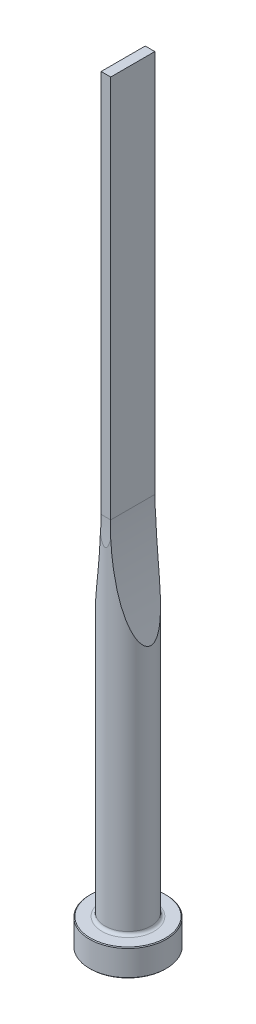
ISO-10303-21;
HEADER;
FILE_DESCRIPTION(('STEP AP214'),'2;1');
FILE_NAME('part.step','',(''),(''),'','','');
FILE_SCHEMA(('AUTOMOTIVE_DESIGN { 1 0 10303 214 1 1 1 1 }'));
ENDSEC;
DATA;
#1=APPLICATION_CONTEXT('core data for automotive mechanical design processes');
#2=APPLICATION_PROTOCOL_DEFINITION('international standard','automotive_design',2000,#1);
#3=PRODUCT_CONTEXT('',#1,'mechanical');
#4=PRODUCT('Part','Part','',(#3));
#5=PRODUCT_RELATED_PRODUCT_CATEGORY('part','',(#4));
#6=PRODUCT_DEFINITION_FORMATION('','',#4);
#7=PRODUCT_DEFINITION_CONTEXT('part definition',#1,'design');
#8=PRODUCT_DEFINITION('design','',#6,#7);
#9=PRODUCT_DEFINITION_SHAPE('','',#8);
#10=(LENGTH_UNIT() NAMED_UNIT(*) SI_UNIT(.MILLI.,.METRE.));
#11=(NAMED_UNIT(*) PLANE_ANGLE_UNIT() SI_UNIT($,.RADIAN.));
#12=(NAMED_UNIT(*) SI_UNIT($,.STERADIAN.) SOLID_ANGLE_UNIT());
#13=UNCERTAINTY_MEASURE_WITH_UNIT(LENGTH_MEASURE(1.E-05),#10,'distance_accuracy_value','');
#14=(GEOMETRIC_REPRESENTATION_CONTEXT(3) GLOBAL_UNCERTAINTY_ASSIGNED_CONTEXT((#13)) GLOBAL_UNIT_ASSIGNED_CONTEXT((#10,
#11,#12)) REPRESENTATION_CONTEXT('',''));
#15=CARTESIAN_POINT('',(0.,0.,0.));
#16=DIRECTION('',(0.,0.,1.));
#17=DIRECTION('',(1.,0.,0.));
#18=AXIS2_PLACEMENT_3D('',#15,#16,#17);
#19=CARTESIAN_POINT('',(0.,0.,0.));
#20=DIRECTION('',(0.,1.,0.));
#21=DIRECTION('',(-1.,0.,0.));
#22=AXIS2_PLACEMENT_3D('',#19,#20,#21);
#23=PLANE('',#22);
#24=CARTESIAN_POINT('',(0.,0.,0.));
#25=DIRECTION('',(0.,1.,0.));
#26=DIRECTION('',(-1.,0.,0.));
#27=AXIS2_PLACEMENT_3D('',#24,#25,#26);
#28=CIRCLE('',#27,9.8);
#29=CARTESIAN_POINT('',(-9.8,0.,0.));
#30=VERTEX_POINT('',#29);
#31=EDGE_CURVE('E133',#30,#30,#28,.T.);
#32=ORIENTED_EDGE('',*,*,#31,.F.);
#33=EDGE_LOOP('',(#32));
#34=FACE_BOUND('',#33,.T.);
#35=ADVANCED_FACE('F32',(#34),#23,.F.);
#36=CARTESIAN_POINT('',(0.,0.,0.));
#37=DIRECTION('',(0.,1.,0.));
#38=DIRECTION('',(-1.,0.,0.));
#39=AXIS2_PLACEMENT_3D('',#36,#37,#38);
#40=CONICAL_SURFACE('',#39,9.8,0.785398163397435);
#41=CARTESIAN_POINT('',(0.,0.200000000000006,0.));
#42=DIRECTION('',(0.,1.,0.));
#43=DIRECTION('',(-1.,0.,0.));
#44=AXIS2_PLACEMENT_3D('',#41,#42,#43);
#45=CIRCLE('',#44,10.);
#46=CARTESIAN_POINT('',(-10.,0.200000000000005,0.));
#47=VERTEX_POINT('',#46);
#48=EDGE_CURVE('E130',#47,#47,#45,.T.);
#49=ORIENTED_EDGE('',*,*,#48,.F.);
#50=EDGE_LOOP('',(#49));
#51=FACE_BOUND('',#50,.T.);
#52=ORIENTED_EDGE('',*,*,#31,.T.);
#53=EDGE_LOOP('',(#52));
#54=FACE_BOUND('',#53,.T.);
#55=ADVANCED_FACE('F171',(#51,#54),#40,.T.);
#56=CARTESIAN_POINT('',(0.,200.,0.));
#57=DIRECTION('',(0.,1.,0.));
#58=DIRECTION('',(-1.,0.,0.));
#59=AXIS2_PLACEMENT_3D('',#56,#57,#58);
#60=CYLINDRICAL_SURFACE('',#59,10.);
#61=CARTESIAN_POINT('',(0.,6.8,0.));
#62=DIRECTION('',(0.,1.,0.));
#63=DIRECTION('',(-1.,0.,0.));
#64=AXIS2_PLACEMENT_3D('',#61,#62,#63);
#65=CIRCLE('',#64,10.);
#66=CARTESIAN_POINT('',(-10.,6.8,0.));
#67=VERTEX_POINT('',#66);
#68=EDGE_CURVE('E127',#67,#67,#65,.T.);
#69=ORIENTED_EDGE('',*,*,#68,.F.);
#70=EDGE_LOOP('',(#69));
#71=FACE_BOUND('',#70,.T.);
#72=ORIENTED_EDGE('',*,*,#48,.T.);
#73=EDGE_LOOP('',(#72));
#74=FACE_BOUND('',#73,.T.);
#75=ADVANCED_FACE('F176',(#71,#74),#60,.T.);
#76=CARTESIAN_POINT('',(0.,6.8,0.));
#77=DIRECTION('',(0.,-1.,0.));
#78=DIRECTION('',(1.,0.,0.));
#79=AXIS2_PLACEMENT_3D('',#76,#77,#78);
#80=CONICAL_SURFACE('',#79,10.,0.785398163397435);
#81=CARTESIAN_POINT('',(0.,7.00000000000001,0.));
#82=DIRECTION('',(0.,1.,0.));
#83=DIRECTION('',(-1.,0.,0.));
#84=AXIS2_PLACEMENT_3D('',#81,#82,#83);
#85=CIRCLE('',#84,9.8);
#86=CARTESIAN_POINT('',(-9.8,7.00000000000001,0.));
#87=VERTEX_POINT('',#86);
#88=EDGE_CURVE('E124',#87,#87,#85,.T.);
#89=ORIENTED_EDGE('',*,*,#88,.F.);
#90=EDGE_LOOP('',(#89));
#91=FACE_BOUND('',#90,.T.);
#92=ORIENTED_EDGE('',*,*,#68,.T.);
#93=EDGE_LOOP('',(#92));
#94=FACE_BOUND('',#93,.T.);
#95=ADVANCED_FACE('F183',(#91,#94),#80,.T.);
#96=CARTESIAN_POINT('',(9.8,7.,0.));
#97=DIRECTION('',(0.,-1.,0.));
#98=DIRECTION('',(1.,0.,0.));
#99=AXIS2_PLACEMENT_3D('',#96,#97,#98);
#100=PLANE('',#99);
#101=CARTESIAN_POINT('',(0.,7.00000000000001,0.));
#102=DIRECTION('',(0.,1.,0.));
#103=DIRECTION('',(-1.,0.,0.));
#104=AXIS2_PLACEMENT_3D('',#101,#102,#103);
#105=CIRCLE('',#104,6.80000000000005);
#106=CARTESIAN_POINT('',(-6.80000000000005,7.00000000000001,0.));
#107=VERTEX_POINT('',#106);
#108=EDGE_CURVE('E121',#107,#107,#105,.T.);
#109=ORIENTED_EDGE('',*,*,#108,.F.);
#110=EDGE_LOOP('',(#109));
#111=FACE_BOUND('',#110,.T.);
#112=ORIENTED_EDGE('',*,*,#88,.T.);
#113=EDGE_LOOP('',(#112));
#114=FACE_BOUND('',#113,.T.);
#115=ADVANCED_FACE('F190',(#111,#114),#100,.F.);
#116=CARTESIAN_POINT('',(0.,7.8,0.));
#117=DIRECTION('',(0.,1.,0.));
#118=DIRECTION('',(-1.,0.,0.));
#119=AXIS2_PLACEMENT_3D('',#116,#117,#118);
#120=TOROIDAL_SURFACE('',#119,6.80000000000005,0.8);
#121=CARTESIAN_POINT('',(0.,7.8,0.));
#122=DIRECTION('',(0.,1.,0.));
#123=DIRECTION('',(-1.,0.,0.));
#124=AXIS2_PLACEMENT_3D('',#121,#122,#123);
#125=CIRCLE('',#124,6.00000000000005);
#126=CARTESIAN_POINT('',(-6.00000000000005,7.8,0.));
#127=VERTEX_POINT('',#126);
#128=EDGE_CURVE('E112',#127,#127,#125,.T.);
#129=ORIENTED_EDGE('',*,*,#128,.F.);
#130=EDGE_LOOP('',(#129));
#131=FACE_BOUND('',#130,.T.);
#132=ORIENTED_EDGE('',*,*,#108,.T.);
#133=EDGE_LOOP('',(#132));
#134=FACE_BOUND('',#133,.T.);
#135=ADVANCED_FACE('F168',(#131,#134),#120,.F.);
#136=CARTESIAN_POINT('',(0.,200.,0.));
#137=DIRECTION('',(0.,1.,0.));
#138=DIRECTION('',(-1.,0.,0.));
#139=AXIS2_PLACEMENT_3D('',#136,#137,#138);
#140=CYLINDRICAL_SURFACE('',#139,6.00000000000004);
#141=CARTESIAN_POINT('',(6.00000000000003,71.1480070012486,0.));
#142=CARTESIAN_POINT('',(5.99999252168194,71.1480280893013,0.122644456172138));
#143=CARTESIAN_POINT('',(5.99618793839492,71.1592631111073,0.245422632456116));
#144=CARTESIAN_POINT('',(5.98145295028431,71.2028583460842,0.486778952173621));
#145=CARTESIAN_POINT('',(5.9705076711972,71.2352626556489,0.605347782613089));
#146=CARTESIAN_POINT('',(5.93958053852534,71.3271009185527,0.861102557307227));
#147=CARTESIAN_POINT('',(5.91812144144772,71.3909703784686,0.996490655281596));
#148=CARTESIAN_POINT('',(5.86882600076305,71.5384269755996,1.2547024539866));
#149=CARTESIAN_POINT('',(5.84097779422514,71.6220508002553,1.37750215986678));
#150=CARTESIAN_POINT('',(5.78605390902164,71.7879416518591,1.59109296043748));
#151=CARTESIAN_POINT('',(5.75964606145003,71.8680402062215,1.68378290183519));
#152=CARTESIAN_POINT('',(5.70466987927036,72.0356606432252,1.86156052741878));
#153=CARTESIAN_POINT('',(5.6760999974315,72.1231878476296,1.94664267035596));
#154=CARTESIAN_POINT('',(5.61738220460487,72.3040826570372,2.11011216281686));
#155=CARTESIAN_POINT('',(5.58723113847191,72.3974620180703,2.18848523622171));
#156=CARTESIAN_POINT('',(5.52586683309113,72.5886323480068,2.33910280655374));
#157=CARTESIAN_POINT('',(5.49465385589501,72.686422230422,2.41134880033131));
#158=CARTESIAN_POINT('',(5.4211814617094,72.9180303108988,2.57314390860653));
#159=CARTESIAN_POINT('',(5.37864227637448,73.0531885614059,2.66064244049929));
#160=CARTESIAN_POINT('',(5.29281617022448,73.3282296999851,2.827524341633));
#161=CARTESIAN_POINT('',(5.24952893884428,73.4681145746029,2.90690424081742));
#162=CARTESIAN_POINT('',(5.1625399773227,73.7517378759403,3.05873243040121));
#163=CARTESIAN_POINT('',(5.11883772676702,73.8954817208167,3.13117024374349));
#164=CARTESIAN_POINT('',(5.0313551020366,74.1858899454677,3.26989103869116));
#165=CARTESIAN_POINT('',(4.98757471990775,74.3325546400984,3.33617335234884));
#166=CARTESIAN_POINT('',(4.89994655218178,74.6289090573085,3.46360040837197));
#167=CARTESIAN_POINT('',(4.85609934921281,74.7786094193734,3.52472070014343));
#168=CARTESIAN_POINT('',(4.7686888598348,75.0799790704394,3.64210927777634));
#169=CARTESIAN_POINT('',(4.72512558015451,75.2316484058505,3.69837744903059));
#170=CARTESIAN_POINT('',(4.6384433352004,75.536489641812,3.8065260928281));
#171=CARTESIAN_POINT('',(4.59532398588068,75.6896599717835,3.85841069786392));
#172=CARTESIAN_POINT('',(4.50957930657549,75.997397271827,3.95828528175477));
#173=CARTESIAN_POINT('',(4.46695397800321,76.151964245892,4.00627524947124));
#174=CARTESIAN_POINT('',(4.35547403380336,76.560496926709,4.12799496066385));
#175=CARTESIAN_POINT('',(4.28709072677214,76.8154662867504,4.19879530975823));
#176=CARTESIAN_POINT('',(4.15206995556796,77.3279723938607,4.33235742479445));
#177=CARTESIAN_POINT('',(4.08543269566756,77.5855094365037,4.39511825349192));
#178=CARTESIAN_POINT('',(3.95405098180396,78.1027737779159,4.51368089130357));
#179=CARTESIAN_POINT('',(3.88930733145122,78.362501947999,4.56947977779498));
#180=CARTESIAN_POINT('',(3.7618638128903,78.8837023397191,4.67495531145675));
#181=CARTESIAN_POINT('',(3.6991640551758,79.1451746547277,4.72463162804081));
#182=CARTESIAN_POINT('',(3.5140512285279,79.9327523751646,4.86576303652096));
#183=CARTESIAN_POINT('',(3.39486370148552,80.4610781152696,4.94911108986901));
#184=CARTESIAN_POINT('',(3.16559819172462,81.5220975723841,5.09879116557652));
#185=CARTESIAN_POINT('',(3.05552118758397,82.0547917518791,5.16512136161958));
#186=CARTESIAN_POINT('',(2.89730686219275,82.857180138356,5.25445264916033));
#187=CARTESIAN_POINT('',(2.84564290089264,83.1256270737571,5.28257204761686));
#188=CARTESIAN_POINT('',(2.74471435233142,83.6632557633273,5.33570962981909));
#189=CARTESIAN_POINT('',(2.69544957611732,83.9324374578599,5.36072805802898));
#190=CARTESIAN_POINT('',(2.55127641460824,84.7410276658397,5.43161935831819));
#191=CARTESIAN_POINT('',(2.45999450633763,85.2814543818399,5.47332531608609));
#192=CARTESIAN_POINT('',(2.2873302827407,86.3638906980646,5.54769584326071));
#193=CARTESIAN_POINT('',(2.20593745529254,86.9058979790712,5.58037006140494));
#194=CARTESIAN_POINT('',(2.05301992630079,87.9916972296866,5.63842140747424));
#195=CARTESIAN_POINT('',(1.98149538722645,88.5354892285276,5.66379841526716));
#196=CARTESIAN_POINT('',(1.84844546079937,89.6239530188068,5.70860472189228));
#197=CARTESIAN_POINT('',(1.7869096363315,90.1686232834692,5.72804024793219));
#198=CARTESIAN_POINT('',(1.67378553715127,91.2591574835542,5.76211157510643));
#199=CARTESIAN_POINT('',(1.62219752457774,91.8050214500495,5.77674724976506));
#200=CARTESIAN_POINT('',(1.52899515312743,92.8977463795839,5.80211213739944));
#201=CARTESIAN_POINT('',(1.4873818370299,93.4446074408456,5.81284094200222));
#202=CARTESIAN_POINT('',(1.41415608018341,94.5390529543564,5.83108785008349));
#203=CARTESIAN_POINT('',(1.38254367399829,95.086637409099,5.83860594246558));
#204=CARTESIAN_POINT('',(1.32930623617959,96.1828936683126,5.85095649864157));
#205=CARTESIAN_POINT('',(1.30769165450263,96.731566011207,5.85578615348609));
#206=CARTESIAN_POINT('',(1.27450748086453,97.8292307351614,5.86309807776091));
#207=CARTESIAN_POINT('',(1.26293790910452,98.3782231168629,5.86558034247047));
#208=CARTESIAN_POINT('',(1.24984893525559,99.4762931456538,5.8683832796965));
#209=CARTESIAN_POINT('',(1.24832880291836,100.025370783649,5.86870410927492));
#210=CARTESIAN_POINT('',(1.25533745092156,101.123471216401,5.86720894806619));
#211=CARTESIAN_POINT('',(1.26386645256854,101.672494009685,5.86539291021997));
#212=CARTESIAN_POINT('',(1.29090061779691,102.767455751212,5.85950219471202));
#213=CARTESIAN_POINT('',(1.30935423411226,103.313396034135,5.85543918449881));
#214=CARTESIAN_POINT('',(1.35619619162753,104.404812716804,5.84476769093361));
#215=CARTESIAN_POINT('',(1.38458429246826,104.950289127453,5.83815926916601));
#216=CARTESIAN_POINT('',(1.45128701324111,106.040655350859,5.82193652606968));
#217=CARTESIAN_POINT('',(1.48960280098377,106.585545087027,5.8123218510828));
#218=CARTESIAN_POINT('',(1.57614113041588,107.674460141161,5.78945448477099));
#219=CARTESIAN_POINT('',(1.62436362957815,108.218485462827,5.77620180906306));
#220=CARTESIAN_POINT('',(1.73063067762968,109.304840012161,5.74525700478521));
#221=CARTESIAN_POINT('',(1.78866423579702,109.847170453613,5.72756983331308));
#222=CARTESIAN_POINT('',(1.91455588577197,110.930497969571,5.6867264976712));
#223=CARTESIAN_POINT('',(1.98241415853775,111.471495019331,5.66357023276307));
#224=CARTESIAN_POINT('',(2.12788564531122,112.551720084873,5.61053441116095));
#225=CARTESIAN_POINT('',(2.20549657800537,113.090948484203,5.58065642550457));
#226=CARTESIAN_POINT('',(2.37040873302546,114.167381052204,5.51263391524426));
#227=CARTESIAN_POINT('',(2.45770935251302,114.704585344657,5.47448990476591));
#228=CARTESIAN_POINT('',(2.59201282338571,115.486234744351,5.41143537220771));
#229=CARTESIAN_POINT('',(2.63523328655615,115.731661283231,5.39054625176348));
#230=CARTESIAN_POINT('',(2.72367149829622,116.221936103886,5.34640580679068));
#231=CARTESIAN_POINT('',(2.76888920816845,116.466784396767,5.32315452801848));
#232=CARTESIAN_POINT('',(2.9075217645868,117.200414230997,5.24950501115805));
#233=CARTESIAN_POINT('',(3.00391198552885,117.688257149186,5.19521294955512));
#234=CARTESIAN_POINT('',(3.20489967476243,118.663041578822,5.07370413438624));
#235=CARTESIAN_POINT('',(3.30953321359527,119.149968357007,5.00642847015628));
#236=CARTESIAN_POINT('',(3.52630573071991,120.119644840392,4.85619318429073));
#237=CARTESIAN_POINT('',(3.63844279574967,120.60239557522,4.7732375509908));
#238=CARTESIAN_POINT('',(3.81257994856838,121.325101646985,4.63355313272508));
#239=CARTESIAN_POINT('',(3.87196156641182,121.567109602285,4.58413142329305));
#240=CARTESIAN_POINT('',(3.99243307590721,122.049462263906,4.4796038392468));
#241=CARTESIAN_POINT('',(4.05352287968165,122.289807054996,4.42449825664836));
#242=CARTESIAN_POINT('',(4.17737477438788,122.768821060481,4.30775940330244));
#243=CARTESIAN_POINT('',(4.24013887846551,123.007487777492,4.24611798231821));
#244=CARTESIAN_POINT('',(4.36710464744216,123.482395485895,4.11542247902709));
#245=CARTESIAN_POINT('',(4.43130623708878,123.718636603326,4.04636878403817));
#246=CARTESIAN_POINT('',(4.56043310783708,124.18630560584,3.90024206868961));
#247=CARTESIAN_POINT('',(4.62534899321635,124.417756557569,3.82323498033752));
#248=CARTESIAN_POINT('',(4.75610292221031,124.876952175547,3.65930202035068));
#249=CARTESIAN_POINT('',(4.82194117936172,125.104695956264,3.57237381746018));
#250=CARTESIAN_POINT('',(4.95392961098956,125.554707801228,3.38696166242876));
#251=CARTESIAN_POINT('',(5.02007870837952,125.776987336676,3.28850496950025));
#252=CARTESIAN_POINT('',(5.15215404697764,126.214748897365,3.07747340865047));
#253=CARTESIAN_POINT('',(5.21808040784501,126.43023537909,2.96490804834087));
#254=CARTESIAN_POINT('',(5.31394944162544,126.739595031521,2.78676803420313));
#255=CARTESIAN_POINT('',(5.34439862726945,126.837247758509,2.72800628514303));
#256=CARTESIAN_POINT('',(5.40485413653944,127.030004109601,2.60618203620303));
#257=CARTESIAN_POINT('',(5.43486041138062,127.125107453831,2.54311906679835));
#258=CARTESIAN_POINT('',(5.49425843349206,127.312312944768,2.41211667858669));
#259=CARTESIAN_POINT('',(5.52364932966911,127.404411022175,2.34417101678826));
#260=CARTESIAN_POINT('',(5.58148621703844,127.584682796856,2.20291205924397));
#261=CARTESIAN_POINT('',(5.60993234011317,127.672857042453,2.12959951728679));
#262=CARTESIAN_POINT('',(5.68541013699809,127.905639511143,1.92239994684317));
#263=CARTESIAN_POINT('',(5.7312027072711,128.045567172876,1.78265212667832));
#264=CARTESIAN_POINT('',(5.8161344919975,128.303231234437,1.48216093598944));
#265=CARTESIAN_POINT('',(5.85529370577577,128.421034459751,1.32148335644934));
#266=CARTESIAN_POINT('',(5.90938819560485,128.582936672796,1.04430418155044));
#267=CARTESIAN_POINT('',(5.92782413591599,128.637889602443,0.934890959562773));
#268=CARTESIAN_POINT('',(5.95913398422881,128.73100388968,0.708345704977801));
#269=CARTESIAN_POINT('',(5.97201429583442,128.769184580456,0.591222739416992));
#270=CARTESIAN_POINT('',(5.9909880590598,128.825367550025,0.350358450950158));
#271=CARTESIAN_POINT('',(5.99701510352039,128.843172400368,0.226564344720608));
#272=CARTESIAN_POINT('',(6.00124661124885,128.855677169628,-0.0223197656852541));
#273=CARTESIAN_POINT('',(5.99945446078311,128.850387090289,-0.147409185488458));
#274=CARTESIAN_POINT('',(5.98897538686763,128.819401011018,-0.379606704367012));
#275=CARTESIAN_POINT('',(5.98112361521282,128.796176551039,-0.487100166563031));
#276=CARTESIAN_POINT('',(5.96030773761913,128.734464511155,-0.697052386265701));
#277=CARTESIAN_POINT('',(5.94734054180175,128.695967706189,-0.799508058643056));
#278=CARTESIAN_POINT('',(5.90966135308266,128.583764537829,-1.04821727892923));
#279=CARTESIAN_POINT('',(5.88232531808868,128.50209532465,-1.19045464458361));
#280=CARTESIAN_POINT('',(5.82133461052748,128.318765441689,-1.45989343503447));
#281=CARTESIAN_POINT('',(5.78766248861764,128.217049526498,-1.58705171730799));
#282=CARTESIAN_POINT('',(5.72023684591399,128.011961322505,-1.81419145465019));
#283=CARTESIAN_POINT('',(5.68690674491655,127.91002456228,-1.91562288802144));
#284=CARTESIAN_POINT('',(5.61807166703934,127.698109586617,-2.10898431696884));
#285=CARTESIAN_POINT('',(5.58256487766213,127.588124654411,-2.20090621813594));
#286=CARTESIAN_POINT('',(5.51006275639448,127.361968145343,-2.37660535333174));
#287=CARTESIAN_POINT('',(5.47306450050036,127.245784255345,-2.4603653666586));
#288=CARTESIAN_POINT('',(5.39817254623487,127.008872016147,-2.62059961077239));
#289=CARTESIAN_POINT('',(5.36027914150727,126.888145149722,-2.6970761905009));
#290=CARTESIAN_POINT('',(5.26718075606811,126.589262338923,-2.87593311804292));
#291=CARTESIAN_POINT('',(5.2116842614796,126.409178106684,-2.97493259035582));
#292=CARTESIAN_POINT('',(5.10029937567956,126.043534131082,-3.16208569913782));
#293=CARTESIAN_POINT('',(5.04441080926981,125.857971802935,-3.25023411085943));
#294=CARTESIAN_POINT('',(4.93265417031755,125.482430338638,-3.41746222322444));
#295=CARTESIAN_POINT('',(4.87678628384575,125.292444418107,-3.49652671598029));
#296=CARTESIAN_POINT('',(4.76549494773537,124.909239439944,-3.64675072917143));
#297=CARTESIAN_POINT('',(4.7100715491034,124.716020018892,-3.71790935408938));
#298=CARTESIAN_POINT('',(4.59964672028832,124.326067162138,-3.85369192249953));
#299=CARTESIAN_POINT('',(4.54464863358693,124.129321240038,-3.91828254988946));
#300=CARTESIAN_POINT('',(4.43552311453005,123.733704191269,-4.04139805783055));
#301=CARTESIAN_POINT('',(4.38139570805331,123.534833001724,-4.09992275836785));
#302=CARTESIAN_POINT('',(4.27420253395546,123.135542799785,-4.21155238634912));
#303=CARTESIAN_POINT('',(4.22113568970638,122.93512567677,-4.264663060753));
#304=CARTESIAN_POINT('',(4.11610452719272,122.532809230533,-4.36612054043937));
#305=CARTESIAN_POINT('',(4.06414020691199,122.330909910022,-4.41446735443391));
#306=CARTESIAN_POINT('',(3.92557394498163,121.784635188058,-4.539124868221));
#307=CARTESIAN_POINT('',(3.84008066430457,121.439061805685,-4.61143245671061));
#308=CARTESIAN_POINT('',(3.67276769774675,120.745020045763,-4.74576314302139));
#309=CARTESIAN_POINT('',(3.59094846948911,120.396551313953,-4.80778496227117));
#310=CARTESIAN_POINT('',(3.43114676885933,119.697150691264,-4.9231028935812));
#311=CARTESIAN_POINT('',(3.35316590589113,119.346217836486,-4.97639536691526));
#312=CARTESIAN_POINT('',(3.20120804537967,118.642420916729,-5.07547918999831));
#313=CARTESIAN_POINT('',(3.12723126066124,118.289556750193,-5.12127014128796));
#314=CARTESIAN_POINT('',(2.98323529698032,117.581496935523,-5.20646913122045));
#315=CARTESIAN_POINT('',(2.91322451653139,117.226297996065,-5.24586393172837));
#316=CARTESIAN_POINT('',(2.77739408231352,116.514517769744,-5.31902413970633));
#317=CARTESIAN_POINT('',(2.71157455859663,116.157936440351,-5.35278937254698));
#318=CARTESIAN_POINT('',(2.52051939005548,115.08659687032,-5.44676258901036));
#319=CARTESIAN_POINT('',(2.40164783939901,114.370049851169,-5.49967045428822));
#320=CARTESIAN_POINT('',(2.18097751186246,112.93210757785,-5.59084552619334));
#321=CARTESIAN_POINT('',(2.07921035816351,112.210705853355,-5.6290857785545));
#322=CARTESIAN_POINT('',(1.89316918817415,110.765123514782,-5.69435012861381));
#323=CARTESIAN_POINT('',(1.808895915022,110.040942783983,-5.72137374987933));
#324=CARTESIAN_POINT('',(1.65803395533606,108.591282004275,-5.76689841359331));
#325=CARTESIAN_POINT('',(1.59142610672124,107.865804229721,-5.78540870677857));
#326=CARTESIAN_POINT('',(1.47583821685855,106.413319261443,-5.81596576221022));
#327=CARTESIAN_POINT('',(1.42685817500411,105.686312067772,-5.82801252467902));
#328=CARTESIAN_POINT('',(1.33557886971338,104.032134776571,-5.84970538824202));
#329=CARTESIAN_POINT('',(1.29877643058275,103.104636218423,-5.85779222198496));
#330=CARTESIAN_POINT('',(1.25387900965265,101.248889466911,-5.86756279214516));
#331=CARTESIAN_POINT('',(1.24578503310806,100.320641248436,-5.869246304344));
#332=CARTESIAN_POINT('',(1.25832051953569,98.4636356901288,-5.86657302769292));
#333=CARTESIAN_POINT('',(1.27897187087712,97.5348785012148,-5.86221163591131));
#334=CARTESIAN_POINT('',(1.3490117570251,95.678537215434,-5.84649034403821));
#335=CARTESIAN_POINT('',(1.39839945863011,94.7509530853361,-5.83513064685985));
#336=CARTESIAN_POINT('',(1.5256364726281,92.9010454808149,-5.80316878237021));
#337=CARTESIAN_POINT('',(1.60338814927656,91.9787148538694,-5.78259826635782));
#338=CARTESIAN_POINT('',(1.74128966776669,90.5976112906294,-5.74196407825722));
#339=CARTESIAN_POINT('',(1.79080682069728,90.1376092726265,-5.72678817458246));
#340=CARTESIAN_POINT('',(1.89690986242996,89.2185699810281,-5.69252641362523));
#341=CARTESIAN_POINT('',(1.95349560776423,88.7595326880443,-5.67344063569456));
#342=CARTESIAN_POINT('',(2.07364787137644,87.8430425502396,-5.63063453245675));
#343=CARTESIAN_POINT('',(2.13720755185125,87.385588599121,-5.60691872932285));
#344=CARTESIAN_POINT('',(2.27130980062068,86.4720356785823,-5.55394928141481));
#345=CARTESIAN_POINT('',(2.34185216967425,86.0159366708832,-5.52469579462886));
#346=CARTESIAN_POINT('',(2.4898487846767,85.1054291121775,-5.45959598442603));
#347=CARTESIAN_POINT('',(2.56730155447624,84.6510202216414,-5.4237510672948));
#348=CARTESIAN_POINT('',(2.72904946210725,83.7441259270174,-5.3441951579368));
#349=CARTESIAN_POINT('',(2.81334423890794,83.2916404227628,-5.30048458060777));
#350=CARTESIAN_POINT('',(2.96709144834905,82.5000509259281,-5.21555922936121));
#351=CARTESIAN_POINT('',(3.03509178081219,82.1604464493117,-5.17637720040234));
#352=CARTESIAN_POINT('',(3.17485079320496,81.4827707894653,-5.09185601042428));
#353=CARTESIAN_POINT('',(3.24660950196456,81.1446996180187,-5.04651680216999));
#354=CARTESIAN_POINT('',(3.39372907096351,80.4706747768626,-4.94877727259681));
#355=CARTESIAN_POINT('',(3.46908674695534,80.1347195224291,-4.89638312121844));
#356=CARTESIAN_POINT('',(3.62333606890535,79.465009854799,-4.78336577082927));
#357=CARTESIAN_POINT('',(3.70222757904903,79.1312553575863,-4.72274288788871));
#358=CARTESIAN_POINT('',(3.83929146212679,78.5657852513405,-4.61141276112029));
#359=CARTESIAN_POINT('',(3.89661078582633,78.3333799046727,-4.56315560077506));
#360=CARTESIAN_POINT('',(4.01281641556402,77.8701374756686,-4.46130900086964));
#361=CARTESIAN_POINT('',(4.07170266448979,77.6393003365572,-4.40771975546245));
#362=CARTESIAN_POINT('',(4.19104857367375,77.1790535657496,-4.29440309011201));
#363=CARTESIAN_POINT('',(4.25151096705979,76.9496474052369,-4.23466439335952));
#364=CARTESIAN_POINT('',(4.37375740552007,76.493100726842,-4.10828145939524));
#365=CARTESIAN_POINT('',(4.43554140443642,76.2659601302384,-4.04163746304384));
#366=CARTESIAN_POINT('',(4.56691534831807,75.7902904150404,-3.89283650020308));
#367=CARTESIAN_POINT('',(4.63663289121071,75.5420746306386,-3.80978259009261));
#368=CARTESIAN_POINT('',(4.77710170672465,75.0499834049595,-3.63209895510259));
#369=CARTESIAN_POINT('',(4.84785329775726,74.8061093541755,-3.53746559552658));
#370=CARTESIAN_POINT('',(4.98957510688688,74.3250753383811,-3.33457940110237));
#371=CARTESIAN_POINT('',(5.06054393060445,74.087896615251,-3.22637048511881));
#372=CARTESIAN_POINT('',(5.20199383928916,73.6219838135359,-2.99297983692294));
#373=CARTESIAN_POINT('',(5.2724752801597,73.3932428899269,-2.86781226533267));
#374=CARTESIAN_POINT('',(5.39502311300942,73.0008395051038,-2.62816839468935));
#375=CARTESIAN_POINT('',(5.44749923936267,72.8345893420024,-2.51817503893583));
#376=CARTESIAN_POINT('',(5.55029648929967,72.5120125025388,-2.28270917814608));
#377=CARTESIAN_POINT('',(5.60061350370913,72.3557044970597,-2.15720878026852));
#378=CARTESIAN_POINT('',(5.69770401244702,72.056671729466,-1.88606041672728));
#379=CARTESIAN_POINT('',(5.74443119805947,71.9141198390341,-1.74020139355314));
#380=CARTESIAN_POINT('',(5.83039285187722,71.6537596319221,-1.425781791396));
#381=CARTESIAN_POINT('',(5.86965408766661,71.5358627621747,-1.25730615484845));
#382=CARTESIAN_POINT('',(5.92189290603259,71.3797632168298,-0.970960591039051));
#383=CARTESIAN_POINT('',(5.93903183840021,71.3287478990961,-0.860884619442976));
#384=CARTESIAN_POINT('',(5.96754078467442,71.2440587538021,-0.633614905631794));
#385=CARTESIAN_POINT('',(5.97892566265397,71.2103402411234,-0.516440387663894));
#386=CARTESIAN_POINT('',(5.99117669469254,71.1740876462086,-0.331820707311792));
#387=CARTESIAN_POINT('',(5.99447157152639,71.164346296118,-0.265899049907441));
#388=CARTESIAN_POINT('',(5.99888554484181,71.1512993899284,-0.133331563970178));
#389=CARTESIAN_POINT('',(6.00000406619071,71.1479955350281,-0.0666855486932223));
#390=CARTESIAN_POINT('',(6.00000000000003,71.1480070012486,0.));
#391=B_SPLINE_CURVE_WITH_KNOTS('',3,(#141,#142,#143,#144,#145,#146,#147,#148,#149,#150,#151,
#152,#153,#154,#155,#156,#157,#158,#159,#160,#161,#162,#163,#164,#165,#166,#167,#168,#169,#170,
#171,#172,#173,#174,#175,#176,#177,#178,#179,#180,#181,#182,#183,#184,#185,#186,#187,#188,#189,
#190,#191,#192,#193,#194,#195,#196,#197,#198,#199,#200,#201,#202,#203,#204,#205,#206,#207,#208,
#209,#210,#211,#212,#213,#214,#215,#216,#217,#218,#219,#220,#221,#222,#223,#224,#225,#226,#227,
#228,#229,#230,#231,#232,#233,#234,#235,#236,#237,#238,#239,#240,#241,#242,#243,#244,#245,#246,
#247,#248,#249,#250,#251,#252,#253,#254,#255,#256,#257,#258,#259,#260,#261,#262,#263,#264,#265,
#266,#267,#268,#269,#270,#271,#272,#273,#274,#275,#276,#277,#278,#279,#280,#281,#282,#283,#284,
#285,#286,#287,#288,#289,#290,#291,#292,#293,#294,#295,#296,#297,#298,#299,#300,#301,#302,#303,
#304,#305,#306,#307,#308,#309,#310,#311,#312,#313,#314,#315,#316,#317,#318,#319,#320,#321,#322,
#323,#324,#325,#326,#327,#328,#329,#330,#331,#332,#333,#334,#335,#336,#337,#338,#339,#340,#341,
#342,#343,#344,#345,#346,#347,#348,#349,#350,#351,#352,#353,#354,#355,#356,#357,#358,#359,#360,
#361,#362,#363,#364,#365,#366,#367,#368,#369,#370,#371,#372,#373,#374,#375,#376,#377,#378,#379,
#380,#381,#382,#383,#384,#385,#386,#387,#388,#389,#390),.UNSPECIFIED.,.T.,.F.,(4,2,2,2,2,2,2,2,
2,2,2,2,2,2,2,2,2,2,2,2,2,2,2,2,2,2,2,2,2,2,2,2,2,2,2,2,2,2,2,2,2,2,2,2,2,2,2,2,2,2,2,2,2,2,2,2,
2,2,2,2,2,2,2,2,2,2,2,2,2,2,2,2,2,2,2,2,2,2,2,2,2,2,2,2,2,2,2,2,2,2,2,2,2,2,2,2,2,2,2,2,2,2,2,2,
2,2,2,2,2,2,2,2,2,2,2,2,2,2,2,2,2,2,2,2,4),(0.,0.367632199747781,0.736032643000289,
1.18715483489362,1.63912152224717,2.01454826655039,2.39024626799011,2.76672480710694,
3.14311110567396,3.64236820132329,4.14183780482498,4.64204971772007,5.1423158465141,
5.64483223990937,6.14736049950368,6.64940960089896,7.15146013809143,7.97121717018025,
8.79106968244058,9.61126521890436,10.4315050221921,12.0749599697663,13.7185912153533,
14.5430129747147,15.3673696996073,17.0161659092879,18.6631938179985,20.3102488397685,
21.9555716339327,23.6009377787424,25.2464758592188,26.8920196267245,28.5392794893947,
30.1865426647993,31.8336861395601,33.4808658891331,35.119571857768,36.7582381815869,
38.397097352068,40.0359494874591,41.6729777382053,43.3100361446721,44.9467123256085,
46.5832867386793,47.3335008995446,48.0837005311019,49.5841717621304,51.0916183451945,
52.5986820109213,53.3607433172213,54.1227654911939,54.8857493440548,55.6486933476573,
56.4057552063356,57.1629953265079,57.9184797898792,58.6734578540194,59.0272729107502,
59.3811266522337,59.7354411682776,60.08970601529,60.6970359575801,61.3025009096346,
61.6727478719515,62.0425669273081,62.4159397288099,62.7891508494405,63.118495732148,
63.4480398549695,63.9440333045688,64.4414132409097,64.8836162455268,65.3261926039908,
65.7696834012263,66.2130306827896,66.8511576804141,67.4895907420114,68.1290775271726,
68.7686366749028,69.4112931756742,70.0539687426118,70.6959548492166,71.3379397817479,
72.4274960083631,73.5171875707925,74.6073322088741,75.6975347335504,76.7899656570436,
77.8824304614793,80.0667651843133,82.255094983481,84.4435177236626,86.6295568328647,
88.8155958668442,91.5998961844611,94.3842939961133,97.1708131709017,99.9572515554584,
102.734187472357,104.12285456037,105.511493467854,106.898782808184,108.286032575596,
109.672986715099,111.059867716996,112.105464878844,113.151070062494,114.19576667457,
115.240423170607,115.972921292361,116.705392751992,117.439232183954,118.173046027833,
118.985414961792,119.798039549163,120.608099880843,121.417487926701,122.035280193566,
122.654200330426,123.280093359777,123.90369823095,124.270054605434,124.635459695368,
124.835299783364,125.035192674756),.UNSPECIFIED.);
#392=CARTESIAN_POINT('',(1.34687364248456,95.8253298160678,-5.84687364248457));
#393=VERTEX_POINT('',#392);
#394=CARTESIAN_POINT('',(1.34687364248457,95.8253298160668,5.84687364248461));
#395=VERTEX_POINT('',#394);
#396=EDGE_CURVE('E138',#393,#395,#391,.T.);
#397=ORIENTED_EDGE('',*,*,#396,.T.);
#398=CARTESIAN_POINT('',(-1.71391365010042,100.,5.74999999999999));
#399=CARTESIAN_POINT('',(-1.71391988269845,100.360232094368,5.75000022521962));
#400=CARTESIAN_POINT('',(-1.70670690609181,100.7204849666,5.75216429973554));
#401=CARTESIAN_POINT('',(-1.67730271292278,101.440311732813,5.76080572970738));
#402=CARTESIAN_POINT('',(-1.65511191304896,101.799885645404,5.76728296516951));
#403=CARTESIAN_POINT('',(-1.59385315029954,102.518394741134,5.78452322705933));
#404=CARTESIAN_POINT('',(-1.55474710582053,102.877326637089,5.79529591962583));
#405=CARTESIAN_POINT('',(-1.48033674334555,103.413272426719,5.81457014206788));
#406=CARTESIAN_POINT('',(-1.45292096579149,103.591447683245,5.82151097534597));
#407=CARTESIAN_POINT('',(-1.39191289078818,103.946689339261,5.83640137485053));
#408=CARTESIAN_POINT('',(-1.35832152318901,104.123755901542,5.84435078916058));
#409=CARTESIAN_POINT('',(-1.2912787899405,104.440079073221,5.85948118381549));
#410=CARTESIAN_POINT('',(-1.25921382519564,104.579636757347,5.86648499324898));
#411=CARTESIAN_POINT('',(-1.18926063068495,104.857383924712,5.88106678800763));
#412=CARTESIAN_POINT('',(-1.15136840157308,104.995572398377,5.88864516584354));
#413=CARTESIAN_POINT('',(-1.06831244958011,105.269233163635,5.90427715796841));
#414=CARTESIAN_POINT('',(-1.02317340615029,105.404712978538,5.91232910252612));
#415=CARTESIAN_POINT('',(-0.923002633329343,105.671884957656,5.92880254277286));
#416=CARTESIAN_POINT('',(-0.867986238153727,105.803582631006,5.93722345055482));
#417=CARTESIAN_POINT('',(-0.766634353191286,106.011378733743,5.9509479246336));
#418=CARTESIAN_POINT('',(-0.724867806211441,106.089690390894,5.95622768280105));
#419=CARTESIAN_POINT('',(-0.633381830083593,106.241543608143,5.96665610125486));
#420=CARTESIAN_POINT('',(-0.5836819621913,106.315096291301,5.97180504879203));
#421=CARTESIAN_POINT('',(-0.500547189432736,106.418351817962,5.97914745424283));
#422=CARTESIAN_POINT('',(-0.47147887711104,106.451525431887,5.98152654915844));
#423=CARTESIAN_POINT('',(-0.40975608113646,106.514467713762,5.98607241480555));
#424=CARTESIAN_POINT('',(-0.377102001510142,106.54423676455,5.98823920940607));
#425=CARTESIAN_POINT('',(-0.314953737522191,106.592746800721,5.99179060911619));
#426=CARTESIAN_POINT('',(-0.286256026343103,106.612487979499,5.99324366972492));
#427=CARTESIAN_POINT('',(-0.226115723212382,106.647269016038,5.99581280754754));
#428=CARTESIAN_POINT('',(-0.194679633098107,106.662319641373,5.9969296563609));
#429=CARTESIAN_POINT('',(-0.137318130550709,106.683161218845,5.99847946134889));
#430=CARTESIAN_POINT('',(-0.11189510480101,106.690310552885,5.99901243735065));
#431=CARTESIAN_POINT('',(-0.060206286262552,106.700243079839,5.99975337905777));
#432=CARTESIAN_POINT('',(-0.0339414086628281,106.703030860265,5.99996168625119));
#433=CARTESIAN_POINT('',(0.0187279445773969,106.703927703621,6.00002867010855));
#434=CARTESIAN_POINT('',(0.045132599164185,106.702026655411,5.99988659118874));
#435=CARTESIAN_POINT('',(0.0972283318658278,106.693750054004,5.999268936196));
#436=CARTESIAN_POINT('',(0.122918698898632,106.687370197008,5.99879303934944));
#437=CARTESIAN_POINT('',(0.180222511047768,106.668376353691,5.99737959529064));
#438=CARTESIAN_POINT('',(0.211408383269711,106.654495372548,5.99634851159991));
#439=CARTESIAN_POINT('',(0.271170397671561,106.62198630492,5.99394413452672));
#440=CARTESIAN_POINT('',(0.299740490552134,106.603347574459,5.99257007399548));
#441=CARTESIAN_POINT('',(0.373829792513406,106.548222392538,5.988527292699));
#442=CARTESIAN_POINT('',(0.416890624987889,106.508492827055,5.98563453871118));
#443=CARTESIAN_POINT('',(0.497042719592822,106.423494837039,5.97951175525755));
#444=CARTESIAN_POINT('',(0.534115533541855,106.378210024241,5.97628073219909));
#445=CARTESIAN_POINT('',(0.619887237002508,106.262394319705,5.968113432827));
#446=CARTESIAN_POINT('',(0.665945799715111,106.189938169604,5.96308457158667));
#447=CARTESIAN_POINT('',(0.751194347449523,106.041041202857,5.95294302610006));
#448=CARTESIAN_POINT('',(0.790368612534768,105.964591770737,5.94783017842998));
#449=CARTESIAN_POINT('',(0.863732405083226,105.808846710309,5.93762100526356));
#450=CARTESIAN_POINT('',(0.897893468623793,105.72953779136,5.93252492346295));
#451=CARTESIAN_POINT('',(0.962086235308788,105.569384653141,5.9224519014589));
#452=CARTESIAN_POINT('',(0.99212236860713,105.488542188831,5.91747483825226));
#453=CARTESIAN_POINT('',(1.07256047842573,105.257924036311,5.903594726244));
#454=CARTESIAN_POINT('',(1.11909878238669,105.106793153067,5.8948729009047));
#455=CARTESIAN_POINT('',(1.20416724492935,104.802231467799,5.87808063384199));
#456=CARTESIAN_POINT('',(1.242692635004,104.648799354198,5.87001058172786));
#457=CARTESIAN_POINT('',(1.31348491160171,104.340145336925,5.85457710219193));
#458=CARTESIAN_POINT('',(1.34573891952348,104.184920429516,5.84721514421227));
#459=CARTESIAN_POINT('',(1.40500539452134,103.873431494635,5.83325598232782));
#460=CARTESIAN_POINT('',(1.43201709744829,103.717167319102,5.82665888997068));
#461=CARTESIAN_POINT('',(1.50637758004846,103.247239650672,5.80805390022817));
#462=CARTESIAN_POINT('',(1.54704655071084,102.932464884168,5.79723348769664));
#463=CARTESIAN_POINT('',(1.61419698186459,102.301766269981,5.77888587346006));
#464=CARTESIAN_POINT('',(1.64069532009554,101.985844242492,5.77135475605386));
#465=CARTESIAN_POINT('',(1.68834801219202,101.246171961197,5.75763237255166));
#466=CARTESIAN_POINT('',(1.70466595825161,100.822080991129,5.75275515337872));
#467=CARTESIAN_POINT('',(1.71726032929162,99.9732908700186,5.7490021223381));
#468=CARTESIAN_POINT('',(1.71352141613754,99.5485915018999,5.7501309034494));
#469=CARTESIAN_POINT('',(1.68556859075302,98.6993964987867,5.75839581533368));
#470=CARTESIAN_POINT('',(1.66133235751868,98.2749015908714,5.76553849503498));
#471=CARTESIAN_POINT('',(1.6074302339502,97.639971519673,5.78069922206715));
#472=CARTESIAN_POINT('',(1.58655066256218,97.4287184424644,5.78649055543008));
#473=CARTESIAN_POINT('',(1.5381997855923,97.0070234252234,5.79953269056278));
#474=CARTESIAN_POINT('',(1.51072919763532,96.7965813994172,5.80678333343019));
#475=CARTESIAN_POINT('',(1.44802861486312,96.3762167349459,5.82273739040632));
#476=CARTESIAN_POINT('',(1.41277459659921,96.1662977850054,5.83144528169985));
#477=CARTESIAN_POINT('',(1.33275702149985,95.7480308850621,5.85025220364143));
#478=CARTESIAN_POINT('',(1.28798068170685,95.5396854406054,5.86035309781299));
#479=CARTESIAN_POINT('',(1.18625496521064,95.126695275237,5.88179991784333));
#480=CARTESIAN_POINT('',(1.12934956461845,94.9220400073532,5.89314127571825));
#481=CARTESIAN_POINT('',(1.0306505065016,94.6196788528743,5.91090853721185));
#482=CARTESIAN_POINT('',(0.995571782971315,94.5197661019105,5.91694999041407));
#483=CARTESIAN_POINT('',(0.919681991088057,94.3221755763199,5.92922251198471));
#484=CARTESIAN_POINT('',(0.878874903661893,94.2244963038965,5.93545344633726));
#485=CARTESIAN_POINT('',(0.78930044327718,94.0321154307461,5.94803051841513));
#486=CARTESIAN_POINT('',(0.740485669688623,93.9374358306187,5.95437712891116));
#487=CARTESIAN_POINT('',(0.631843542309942,93.7548335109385,5.96689426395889));
#488=CARTESIAN_POINT('',(0.572086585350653,93.6668724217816,5.97306563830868));
#489=CARTESIAN_POINT('',(0.479606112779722,93.5579485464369,5.98084712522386));
#490=CARTESIAN_POINT('',(0.454538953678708,93.5305824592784,5.9828159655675));
#491=CARTESIAN_POINT('',(0.401755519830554,93.4783815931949,5.98659336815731));
#492=CARTESIAN_POINT('',(0.37403487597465,93.4535511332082,5.98840165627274));
#493=CARTESIAN_POINT('',(0.315263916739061,93.4073263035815,5.99178479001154));
#494=CARTESIAN_POINT('',(0.284178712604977,93.3859751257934,5.9933566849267));
#495=CARTESIAN_POINT('',(0.218804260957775,93.3488867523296,5.99609735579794));
#496=CARTESIAN_POINT('',(0.184526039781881,93.3331310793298,5.99726745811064));
#497=CARTESIAN_POINT('',(0.124190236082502,93.3129968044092,5.99876570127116));
#498=CARTESIAN_POINT('',(0.0988107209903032,93.3066143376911,5.99924175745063));
#499=CARTESIAN_POINT('',(0.0473358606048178,93.2982188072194,5.99986825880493));
#500=CARTESIAN_POINT('',(0.0212412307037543,93.296201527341,6.00001901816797));
#501=CARTESIAN_POINT('',(-0.0309265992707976,93.2967631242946,5.99997707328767));
#502=CARTESIAN_POINT('',(-0.0569997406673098,93.2993472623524,5.99978397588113));
#503=CARTESIAN_POINT('',(-0.108346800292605,93.3088258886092,5.99907682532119));
#504=CARTESIAN_POINT('',(-0.133619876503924,93.3157247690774,5.9985624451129));
#505=CARTESIAN_POINT('',(-0.19109305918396,93.3361090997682,5.99704633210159));
#506=CARTESIAN_POINT('',(-0.222776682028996,93.3510269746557,5.99593905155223));
#507=CARTESIAN_POINT('',(-0.283384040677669,93.3856448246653,5.99338125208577));
#508=CARTESIAN_POINT('',(-0.31230103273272,93.4053560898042,5.99192992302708));
#509=CARTESIAN_POINT('',(-0.388084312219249,93.4640516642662,5.98763173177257));
#510=CARTESIAN_POINT('',(-0.432258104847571,93.5064480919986,5.98455118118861));
#511=CARTESIAN_POINT('',(-0.514319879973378,93.5968518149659,5.97805681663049));
#512=CARTESIAN_POINT('',(-0.552188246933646,93.6448758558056,5.97464201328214));
#513=CARTESIAN_POINT('',(-0.640778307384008,93.7689866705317,5.96592566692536));
#514=CARTESIAN_POINT('',(-0.688534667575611,93.8471585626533,5.96052987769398));
#515=CARTESIAN_POINT('',(-0.776702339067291,94.0075955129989,5.94967920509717));
#516=CARTESIAN_POINT('',(-0.817096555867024,94.0898695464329,5.94422421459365));
#517=CARTESIAN_POINT('',(-0.892584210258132,94.2573402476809,5.93335936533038));
#518=CARTESIAN_POINT('',(-0.927647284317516,94.3425504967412,5.9279499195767));
#519=CARTESIAN_POINT('',(-0.993403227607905,94.5145145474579,5.91728393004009));
#520=CARTESIAN_POINT('',(-1.024100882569,94.60126653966,5.91202722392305));
#521=CARTESIAN_POINT('',(-1.10677762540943,94.8505228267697,5.8972918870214));
#522=CARTESIAN_POINT('',(-1.15453716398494,95.0144369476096,5.88804238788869));
#523=CARTESIAN_POINT('',(-1.2414245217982,95.3446081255,5.87033197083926));
#524=CARTESIAN_POINT('',(-1.28054721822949,95.5108665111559,5.86187152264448));
#525=CARTESIAN_POINT('',(-1.35203825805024,95.8452101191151,5.84579663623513));
#526=CARTESIAN_POINT('',(-1.3843927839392,96.0132983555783,5.83818394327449));
#527=CARTESIAN_POINT('',(-1.44343566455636,96.3505133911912,5.82386503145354));
#528=CARTESIAN_POINT('',(-1.47012321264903,96.5196403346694,5.81715894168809));
#529=CARTESIAN_POINT('',(-1.54288517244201,97.0277771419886,5.79845386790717));
#530=CARTESIAN_POINT('',(-1.58172719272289,97.3678811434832,5.78785176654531));
#531=CARTESIAN_POINT('',(-1.64387131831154,98.049158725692,5.77050081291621));
#532=CARTESIAN_POINT('',(-1.66719057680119,98.3903307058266,5.76374770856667));
#533=CARTESIAN_POINT('',(-1.6938276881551,98.9431148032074,5.75595770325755));
#534=CARTESIAN_POINT('',(-1.70138185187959,99.1545160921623,5.75372300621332));
#535=CARTESIAN_POINT('',(-1.71142095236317,99.5772759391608,5.75074469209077));
#536=CARTESIAN_POINT('',(-1.71390999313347,99.7886343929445,5.74999986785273));
#537=CARTESIAN_POINT('',(-1.71391365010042,100.,5.74999999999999));
#538=B_SPLINE_CURVE_WITH_KNOTS('',3,(#398,#399,#400,#401,#402,#403,#404,#405,#406,#407,#408,
#409,#410,#411,#412,#413,#414,#415,#416,#417,#418,#419,#420,#421,#422,#423,#424,#425,#426,#427,
#428,#429,#430,#431,#432,#433,#434,#435,#436,#437,#438,#439,#440,#441,#442,#443,#444,#445,#446,
#447,#448,#449,#450,#451,#452,#453,#454,#455,#456,#457,#458,#459,#460,#461,#462,#463,#464,#465,
#466,#467,#468,#469,#470,#471,#472,#473,#474,#475,#476,#477,#478,#479,#480,#481,#482,#483,#484,
#485,#486,#487,#488,#489,#490,#491,#492,#493,#494,#495,#496,#497,#498,#499,#500,#501,#502,#503,
#504,#505,#506,#507,#508,#509,#510,#511,#512,#513,#514,#515,#516,#517,#518,#519,#520,#521,#522,
#523,#524,#525,#526,#527,#528,#529,#530,#531,#532,#533,#534,#535,#536,#537),.UNSPECIFIED.,.T.,
.F.,(4,2,2,2,2,2,2,2,2,2,2,2,2,2,2,2,2,2,2,2,2,2,2,2,2,2,2,2,2,2,2,2,2,2,2,2,2,2,2,2,2,2,2,2,2,
2,2,2,2,2,2,2,2,2,2,2,2,2,2,2,2,2,2,2,2,2,2,2,2,4),(0.,1.08064493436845,2.16125980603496,
3.24432025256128,3.78545511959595,4.326508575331,4.75651025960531,5.18680838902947,
5.61567104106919,6.0438735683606,6.31035401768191,6.57618727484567,6.70851662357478,
6.84083107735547,6.94511015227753,7.04914805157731,7.12806303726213,7.20689496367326,
7.28589703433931,7.36497512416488,7.46685047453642,7.56895576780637,7.7439433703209,
7.91946020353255,8.17682522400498,8.43477049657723,8.69412793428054,8.95320460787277,
9.4279757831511,9.90302869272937,10.3790470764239,10.855134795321,11.8073834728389,
12.7584954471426,14.0312004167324,15.3048788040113,16.5799459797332,17.2169454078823,
17.8538755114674,18.4927996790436,19.1325870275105,19.7700930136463,20.0881688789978,
20.406024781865,20.7258349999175,21.0436557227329,21.1550136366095,21.2665581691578,
21.3793963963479,21.491858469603,21.5700494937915,21.6481649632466,21.7263698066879,
21.8046543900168,21.9091703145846,22.0139348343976,22.1968116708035,22.3802471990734,
22.6548472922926,22.930077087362,23.2068200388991,23.4832572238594,23.9958214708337,
24.5086889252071,25.022593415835,25.5365710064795,26.5634918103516,27.5892759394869,
28.2238570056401,28.8579236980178),.UNSPECIFIED.);
#539=CARTESIAN_POINT('',(-1.34687364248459,95.8253298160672,5.84687364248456));
#540=VERTEX_POINT('',#539);
#541=EDGE_CURVE('E104',#395,#540,#538,.T.);
#542=ORIENTED_EDGE('',*,*,#541,.T.);
#543=CARTESIAN_POINT('',(-6.00000000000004,71.1480070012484,0.));
#544=CARTESIAN_POINT('',(-5.99999252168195,71.1480280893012,-0.122644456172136));
#545=CARTESIAN_POINT('',(-5.99618793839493,71.1592631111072,-0.24542263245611));
#546=CARTESIAN_POINT('',(-5.98145295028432,71.202858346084,-0.486778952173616));
#547=CARTESIAN_POINT('',(-5.97050767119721,71.2352626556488,-0.605347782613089));
#548=CARTESIAN_POINT('',(-5.93958053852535,71.3271009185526,-0.861102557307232));
#549=CARTESIAN_POINT('',(-5.91812144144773,71.3909703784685,-0.996490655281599));
#550=CARTESIAN_POINT('',(-5.86882600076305,71.5384269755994,-1.25470245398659));
#551=CARTESIAN_POINT('',(-5.84097779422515,71.6220508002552,-1.37750215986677));
#552=CARTESIAN_POINT('',(-5.78605390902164,71.787941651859,-1.59109296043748));
#553=CARTESIAN_POINT('',(-5.75964606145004,71.8680402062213,-1.6837829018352));
#554=CARTESIAN_POINT('',(-5.70466987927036,72.035660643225,-1.86156052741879));
#555=CARTESIAN_POINT('',(-5.67609999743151,72.1231878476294,-1.94664267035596));
#556=CARTESIAN_POINT('',(-5.61738220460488,72.3040826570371,-2.11011216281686));
#557=CARTESIAN_POINT('',(-5.58723113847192,72.3974620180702,-2.18848523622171));
#558=CARTESIAN_POINT('',(-5.52586683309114,72.5886323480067,-2.33910280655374));
#559=CARTESIAN_POINT('',(-5.49465385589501,72.6864222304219,-2.41134880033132));
#560=CARTESIAN_POINT('',(-5.42118146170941,72.9180303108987,-2.57314390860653));
#561=CARTESIAN_POINT('',(-5.3786422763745,73.0531885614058,-2.66064244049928));
#562=CARTESIAN_POINT('',(-5.2928161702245,73.328229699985,-2.82752434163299));
#563=CARTESIAN_POINT('',(-5.24952893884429,73.4681145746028,-2.90690424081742));
#564=CARTESIAN_POINT('',(-5.1625399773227,73.7517378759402,-3.05873243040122));
#565=CARTESIAN_POINT('',(-5.11883772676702,73.8954817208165,-3.1311702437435));
#566=CARTESIAN_POINT('',(-5.03135510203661,74.1858899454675,-3.26989103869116));
#567=CARTESIAN_POINT('',(-4.98757471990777,74.3325546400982,-3.33617335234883));
#568=CARTESIAN_POINT('',(-4.89994655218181,74.6289090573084,-3.46360040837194));
#569=CARTESIAN_POINT('',(-4.85609934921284,74.7786094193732,-3.5247207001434));
#570=CARTESIAN_POINT('',(-4.76868885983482,75.0799790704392,-3.64210927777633));
#571=CARTESIAN_POINT('',(-4.7251255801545,75.2316484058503,-3.6983774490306));
#572=CARTESIAN_POINT('',(-4.63844333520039,75.5364896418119,-3.80652609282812));
#573=CARTESIAN_POINT('',(-4.59532398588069,75.6896599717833,-3.85841069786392));
#574=CARTESIAN_POINT('',(-4.50957930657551,75.9973972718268,-3.95828528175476));
#575=CARTESIAN_POINT('',(-4.46695397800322,76.1519642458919,-4.00627524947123));
#576=CARTESIAN_POINT('',(-4.35547403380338,76.5604969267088,-4.12799496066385));
#577=CARTESIAN_POINT('',(-4.28709072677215,76.8154662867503,-4.19879530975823));
#578=CARTESIAN_POINT('',(-4.15206995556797,77.3279723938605,-4.33235742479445));
#579=CARTESIAN_POINT('',(-4.08543269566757,77.5855094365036,-4.39511825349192));
#580=CARTESIAN_POINT('',(-3.95405098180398,78.1027737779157,-4.51368089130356));
#581=CARTESIAN_POINT('',(-3.88930733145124,78.3625019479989,-4.56947977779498));
#582=CARTESIAN_POINT('',(-3.76186381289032,78.8837023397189,-4.67495531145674));
#583=CARTESIAN_POINT('',(-3.69916405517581,79.1451746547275,-4.72463162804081));
#584=CARTESIAN_POINT('',(-3.51405122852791,79.9327523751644,-4.86576303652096));
#585=CARTESIAN_POINT('',(-3.39486370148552,80.4610781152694,-4.94911108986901));
#586=CARTESIAN_POINT('',(-3.16559819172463,81.5220975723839,-5.09879116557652));
#587=CARTESIAN_POINT('',(-3.05552118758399,82.0547917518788,-5.16512136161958));
#588=CARTESIAN_POINT('',(-2.89730686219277,82.8571801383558,-5.25445264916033));
#589=CARTESIAN_POINT('',(-2.84564290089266,83.1256270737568,-5.28257204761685));
#590=CARTESIAN_POINT('',(-2.74471435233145,83.663255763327,-5.33570962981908));
#591=CARTESIAN_POINT('',(-2.69544957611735,83.9324374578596,-5.36072805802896));
#592=CARTESIAN_POINT('',(-2.55127641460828,84.7410276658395,-5.43161935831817));
#593=CARTESIAN_POINT('',(-2.45999450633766,85.2814543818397,-5.47332531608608));
#594=CARTESIAN_POINT('',(-2.28733028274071,86.3638906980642,-5.54769584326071));
#595=CARTESIAN_POINT('',(-2.20593745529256,86.9058979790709,-5.58037006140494));
#596=CARTESIAN_POINT('',(-2.0530199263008,87.9916972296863,-5.63842140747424));
#597=CARTESIAN_POINT('',(-1.98149538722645,88.5354892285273,-5.66379841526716));
#598=CARTESIAN_POINT('',(-1.84844546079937,89.6239530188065,-5.70860472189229));
#599=CARTESIAN_POINT('',(-1.78690963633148,90.1686232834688,-5.72804024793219));
#600=CARTESIAN_POINT('',(-1.67378553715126,91.2591574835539,-5.76211157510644));
#601=CARTESIAN_POINT('',(-1.62219752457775,91.8050214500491,-5.77674724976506));
#602=CARTESIAN_POINT('',(-1.52899515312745,92.8977463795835,-5.80211213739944));
#603=CARTESIAN_POINT('',(-1.4873818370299,93.4446074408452,-5.81284094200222));
#604=CARTESIAN_POINT('',(-1.41415608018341,94.5390529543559,-5.8310878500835));
#605=CARTESIAN_POINT('',(-1.38254367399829,95.0866374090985,-5.83860594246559));
#606=CARTESIAN_POINT('',(-1.32930623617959,96.1828936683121,-5.85095649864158));
#607=CARTESIAN_POINT('',(-1.30769165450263,96.7315660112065,-5.85578615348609));
#608=CARTESIAN_POINT('',(-1.27450748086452,97.829230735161,-5.86309807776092));
#609=CARTESIAN_POINT('',(-1.2629379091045,98.3782231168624,-5.86558034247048));
#610=CARTESIAN_POINT('',(-1.24984893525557,99.4762931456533,-5.8683832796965));
#611=CARTESIAN_POINT('',(-1.24832880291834,100.025370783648,-5.86870410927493));
#612=CARTESIAN_POINT('',(-1.25533745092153,101.123471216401,-5.8672089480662));
#613=CARTESIAN_POINT('',(-1.26386645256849,101.672494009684,-5.86539291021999));
#614=CARTESIAN_POINT('',(-1.29090061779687,102.767455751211,-5.85950219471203));
#615=CARTESIAN_POINT('',(-1.30935423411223,103.313396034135,-5.85543918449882));
#616=CARTESIAN_POINT('',(-1.35619619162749,104.404812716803,-5.84476769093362));
#617=CARTESIAN_POINT('',(-1.38458429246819,104.950289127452,-5.83815926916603));
#618=CARTESIAN_POINT('',(-1.45128701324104,106.040655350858,-5.82193652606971));
#619=CARTESIAN_POINT('',(-1.48960280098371,106.585545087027,-5.81232185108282));
#620=CARTESIAN_POINT('',(-1.57614113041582,107.674460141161,-5.78945448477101));
#621=CARTESIAN_POINT('',(-1.62436362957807,108.218485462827,-5.77620180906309));
#622=CARTESIAN_POINT('',(-1.7306306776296,109.30484001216,-5.74525700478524));
#623=CARTESIAN_POINT('',(-1.78866423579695,109.847170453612,-5.72756983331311));
#624=CARTESIAN_POINT('',(-1.91455588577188,110.93049796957,-5.68672649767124));
#625=CARTESIAN_POINT('',(-1.98241415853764,111.47149501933,-5.66357023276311));
#626=CARTESIAN_POINT('',(-2.12788564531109,112.551720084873,-5.610534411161));
#627=CARTESIAN_POINT('',(-2.20549657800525,113.090948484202,-5.58065642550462));
#628=CARTESIAN_POINT('',(-2.37040873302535,114.167381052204,-5.51263391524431));
#629=CARTESIAN_POINT('',(-2.45770935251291,114.704585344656,-5.47448990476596));
#630=CARTESIAN_POINT('',(-2.59201282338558,115.486234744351,-5.41143537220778));
#631=CARTESIAN_POINT('',(-2.63523328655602,115.731661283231,-5.39054625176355));
#632=CARTESIAN_POINT('',(-2.72367149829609,116.221936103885,-5.34640580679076));
#633=CARTESIAN_POINT('',(-2.76888920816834,116.466784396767,-5.32315452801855));
#634=CARTESIAN_POINT('',(-2.90752176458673,117.200414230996,-5.2495050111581));
#635=CARTESIAN_POINT('',(-3.00391198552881,117.688257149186,-5.19521294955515));
#636=CARTESIAN_POINT('',(-3.20489967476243,118.663041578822,-5.07370413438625));
#637=CARTESIAN_POINT('',(-3.30953321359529,119.149968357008,-5.00642847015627));
#638=CARTESIAN_POINT('',(-3.52630573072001,120.119644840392,-4.85619318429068));
#639=CARTESIAN_POINT('',(-3.63844279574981,120.60239557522,-4.77323755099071));
#640=CARTESIAN_POINT('',(-3.81257994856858,121.325101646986,-4.63355313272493));
#641=CARTESIAN_POINT('',(-3.87196156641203,121.567109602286,-4.58413142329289));
#642=CARTESIAN_POINT('',(-3.99243307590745,122.049462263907,-4.4796038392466));
#643=CARTESIAN_POINT('',(-4.0535228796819,122.289807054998,-4.42449825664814));
#644=CARTESIAN_POINT('',(-4.17737477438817,122.768821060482,-4.30775940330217));
#645=CARTESIAN_POINT('',(-4.24013887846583,123.007487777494,-4.2461179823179));
#646=CARTESIAN_POINT('',(-4.36710464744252,123.482395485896,-4.11542247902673));
#647=CARTESIAN_POINT('',(-4.43130623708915,123.718636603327,-4.04636878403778));
#648=CARTESIAN_POINT('',(-4.56043310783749,124.186305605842,-3.90024206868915));
#649=CARTESIAN_POINT('',(-4.62534899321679,124.417756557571,-3.82323498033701));
#650=CARTESIAN_POINT('',(-4.7561029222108,124.876952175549,-3.65930202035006));
#651=CARTESIAN_POINT('',(-4.82194117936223,125.104695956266,-3.5723738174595));
#652=CARTESIAN_POINT('',(-4.9539296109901,125.55470780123,-3.386961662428));
#653=CARTESIAN_POINT('',(-5.02007870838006,125.776987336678,-3.28850496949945));
#654=CARTESIAN_POINT('',(-5.15215404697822,126.214748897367,-3.07747340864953));
#655=CARTESIAN_POINT('',(-5.21808040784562,126.430235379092,-2.96490804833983));
#656=CARTESIAN_POINT('',(-5.31394944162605,126.739595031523,-2.78676803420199));
#657=CARTESIAN_POINT('',(-5.34439862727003,126.83724775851,-2.72800628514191));
#658=CARTESIAN_POINT('',(-5.40485413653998,127.030004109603,-2.60618203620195));
#659=CARTESIAN_POINT('',(-5.43486041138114,127.125107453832,-2.54311906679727));
#660=CARTESIAN_POINT('',(-5.49425843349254,127.31231294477,-2.41211667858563));
#661=CARTESIAN_POINT('',(-5.52364932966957,127.404411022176,-2.34417101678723));
#662=CARTESIAN_POINT('',(-5.58148621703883,127.584682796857,-2.202912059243));
#663=CARTESIAN_POINT('',(-5.60993234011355,127.672857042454,-2.12959951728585));
#664=CARTESIAN_POINT('',(-5.6854101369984,127.905639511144,-1.92239994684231));
#665=CARTESIAN_POINT('',(-5.73120270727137,128.045567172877,-1.7826521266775));
#666=CARTESIAN_POINT('',(-5.8161344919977,128.303231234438,-1.48216093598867));
#667=CARTESIAN_POINT('',(-5.85529370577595,128.421034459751,-1.32148335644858));
#668=CARTESIAN_POINT('',(-5.90938819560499,128.582936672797,-1.04430418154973));
#669=CARTESIAN_POINT('',(-5.92782413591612,128.637889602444,-0.934890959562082));
#670=CARTESIAN_POINT('',(-5.9591339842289,128.73100388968,-0.708345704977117));
#671=CARTESIAN_POINT('',(-5.9720142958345,128.769184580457,-0.591222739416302));
#672=CARTESIAN_POINT('',(-5.99098805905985,128.825367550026,-0.350358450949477));
#673=CARTESIAN_POINT('',(-5.99701510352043,128.843172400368,-0.226564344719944));
#674=CARTESIAN_POINT('',(-6.00124661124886,128.855677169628,0.0223197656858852));
#675=CARTESIAN_POINT('',(-5.99945446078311,128.850387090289,0.147409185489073));
#676=CARTESIAN_POINT('',(-5.98897538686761,128.819401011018,0.379606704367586));
#677=CARTESIAN_POINT('',(-5.98112361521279,128.796176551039,0.487100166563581));
#678=CARTESIAN_POINT('',(-5.96030773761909,128.734464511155,0.697052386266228));
#679=CARTESIAN_POINT('',(-5.94734054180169,128.695967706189,0.799508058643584));
#680=CARTESIAN_POINT('',(-5.90966135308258,128.583764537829,1.04821727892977));
#681=CARTESIAN_POINT('',(-5.88232531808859,128.50209532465,1.19045464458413));
#682=CARTESIAN_POINT('',(-5.82133461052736,128.318765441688,1.45989343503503));
#683=CARTESIAN_POINT('',(-5.78766248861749,128.217049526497,1.58705171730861));
#684=CARTESIAN_POINT('',(-5.72023684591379,128.011961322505,1.81419145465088));
#685=CARTESIAN_POINT('',(-5.68690674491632,127.91002456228,1.91562288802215));
#686=CARTESIAN_POINT('',(-5.61807166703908,127.698109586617,2.10898431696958));
#687=CARTESIAN_POINT('',(-5.58256487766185,127.58812465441,2.20090621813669));
#688=CARTESIAN_POINT('',(-5.51006275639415,127.361968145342,2.37660535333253));
#689=CARTESIAN_POINT('',(-5.47306450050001,127.245784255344,2.46036536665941));
#690=CARTESIAN_POINT('',(-5.39817254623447,127.008872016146,2.62059961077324));
#691=CARTESIAN_POINT('',(-5.36027914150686,126.888145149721,2.69707619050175));
#692=CARTESIAN_POINT('',(-5.26718075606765,126.589262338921,2.87593311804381));
#693=CARTESIAN_POINT('',(-5.21168426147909,126.409178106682,2.97493259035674));
#694=CARTESIAN_POINT('',(-5.10029937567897,126.04353413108,3.16208569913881));
#695=CARTESIAN_POINT('',(-5.04441080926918,125.857971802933,3.25023411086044));
#696=CARTESIAN_POINT('',(-4.93265417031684,125.482430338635,3.4174622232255));
#697=CARTESIAN_POINT('',(-4.87678628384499,125.292444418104,3.49652671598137));
#698=CARTESIAN_POINT('',(-4.76549494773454,124.909239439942,3.64675072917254));
#699=CARTESIAN_POINT('',(-4.71007154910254,124.716020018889,3.71790935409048));
#700=CARTESIAN_POINT('',(-4.5996467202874,124.326067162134,3.85369192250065));
#701=CARTESIAN_POINT('',(-4.54464863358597,124.129321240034,3.9182825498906));
#702=CARTESIAN_POINT('',(-4.435523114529,123.733704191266,4.04139805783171));
#703=CARTESIAN_POINT('',(-4.38139570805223,123.53483300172,4.09992275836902));
#704=CARTESIAN_POINT('',(-4.27420253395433,123.135542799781,4.21155238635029));
#705=CARTESIAN_POINT('',(-4.22113568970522,122.935125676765,4.26466306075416));
#706=CARTESIAN_POINT('',(-4.11610452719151,122.532809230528,4.36612054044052));
#707=CARTESIAN_POINT('',(-4.06414020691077,122.330909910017,4.41446735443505));
#708=CARTESIAN_POINT('',(-3.92557394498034,121.784635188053,4.53912486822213));
#709=CARTESIAN_POINT('',(-3.84008066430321,121.439061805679,4.61143245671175));
#710=CARTESIAN_POINT('',(-3.67276769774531,120.745020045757,4.74576314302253));
#711=CARTESIAN_POINT('',(-3.59094846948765,120.396551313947,4.80778496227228));
#712=CARTESIAN_POINT('',(-3.43114676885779,119.697150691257,4.92310289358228));
#713=CARTESIAN_POINT('',(-3.35316590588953,119.346217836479,4.97639536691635));
#714=CARTESIAN_POINT('',(-3.20120804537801,118.642420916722,5.07547918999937));
#715=CARTESIAN_POINT('',(-3.12723126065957,118.289556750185,5.12127014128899));
#716=CARTESIAN_POINT('',(-2.98323529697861,117.581496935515,5.20646913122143));
#717=CARTESIAN_POINT('',(-2.91322451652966,117.226297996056,5.24586393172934));
#718=CARTESIAN_POINT('',(-2.77739408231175,116.514517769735,5.31902413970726));
#719=CARTESIAN_POINT('',(-2.71157455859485,116.157936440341,5.35278937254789));
#720=CARTESIAN_POINT('',(-2.52051939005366,115.08659687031,5.44676258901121));
#721=CARTESIAN_POINT('',(-2.4016478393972,114.370049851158,5.49967045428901));
#722=CARTESIAN_POINT('',(-2.18097751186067,112.932107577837,5.59084552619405));
#723=CARTESIAN_POINT('',(-2.07921035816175,112.210705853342,5.62908577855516));
#724=CARTESIAN_POINT('',(-1.89316918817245,110.765123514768,5.69435012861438));
#725=CARTESIAN_POINT('',(-1.80889591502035,110.040942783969,5.72137374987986));
#726=CARTESIAN_POINT('',(-1.65803395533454,108.59128200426,5.76689841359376));
#727=CARTESIAN_POINT('',(-1.5914261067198,107.865804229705,5.78540870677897));
#728=CARTESIAN_POINT('',(-1.4758382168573,106.413319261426,5.81596576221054));
#729=CARTESIAN_POINT('',(-1.42685817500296,105.686312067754,5.82801252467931));
#730=CARTESIAN_POINT('',(-1.33557886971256,104.032134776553,5.84970538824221));
#731=CARTESIAN_POINT('',(-1.29877643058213,103.104636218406,5.8577922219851));
#732=CARTESIAN_POINT('',(-1.2538790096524,101.248889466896,5.86756279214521));
#733=CARTESIAN_POINT('',(-1.24578503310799,100.320641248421,5.86924630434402));
#734=CARTESIAN_POINT('',(-1.2583205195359,98.4636356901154,5.86657302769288));
#735=CARTESIAN_POINT('',(-1.27897187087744,97.5348785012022,5.86221163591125));
#736=CARTESIAN_POINT('',(-1.34901175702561,95.6785372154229,5.8464903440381));
#737=CARTESIAN_POINT('',(-1.39839945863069,94.7509530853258,5.83513064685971));
#738=CARTESIAN_POINT('',(-1.52563647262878,92.9010454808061,5.80316878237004));
#739=CARTESIAN_POINT('',(-1.60338814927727,91.9787148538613,5.78259826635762));
#740=CARTESIAN_POINT('',(-1.7412896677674,90.5976112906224,5.741964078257));
#741=CARTESIAN_POINT('',(-1.79080682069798,90.1376092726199,5.72678817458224));
#742=CARTESIAN_POINT('',(-1.89690986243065,89.2185699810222,5.692526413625));
#743=CARTESIAN_POINT('',(-1.95349560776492,88.7595326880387,5.67344063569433));
#744=CARTESIAN_POINT('',(-2.07364787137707,87.8430425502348,5.63063453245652));
#745=CARTESIAN_POINT('',(-2.13720755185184,87.3855885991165,5.60691872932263));
#746=CARTESIAN_POINT('',(-2.27130980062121,86.4720356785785,5.5539492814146));
#747=CARTESIAN_POINT('',(-2.34185216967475,86.0159366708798,5.52469579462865));
#748=CARTESIAN_POINT('',(-2.48984878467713,85.1054291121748,5.45959598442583));
#749=CARTESIAN_POINT('',(-2.56730155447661,84.6510202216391,5.42375106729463));
#750=CARTESIAN_POINT('',(-2.72904946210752,83.7441259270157,5.34419515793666));
#751=CARTESIAN_POINT('',(-2.81334423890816,83.2916404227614,5.30048458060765));
#752=CARTESIAN_POINT('',(-2.9670914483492,82.5000509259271,5.21555922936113));
#753=CARTESIAN_POINT('',(-3.03509178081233,82.1604464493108,5.17637720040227));
#754=CARTESIAN_POINT('',(-3.1748507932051,81.4827707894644,5.0918560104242));
#755=CARTESIAN_POINT('',(-3.24660950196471,81.1446996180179,5.0465168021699));
#756=CARTESIAN_POINT('',(-3.39372907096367,80.4706747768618,4.94877727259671));
#757=CARTESIAN_POINT('',(-3.46908674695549,80.1347195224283,4.89638312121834));
#758=CARTESIAN_POINT('',(-3.62333606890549,79.4650098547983,4.78336577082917));
#759=CARTESIAN_POINT('',(-3.70222757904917,79.1312553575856,4.72274288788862));
#760=CARTESIAN_POINT('',(-3.83929146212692,78.5657852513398,4.61141276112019));
#761=CARTESIAN_POINT('',(-3.89661078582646,78.333379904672,4.56315560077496));
#762=CARTESIAN_POINT('',(-4.01281641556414,77.870137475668,4.46130900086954));
#763=CARTESIAN_POINT('',(-4.0717026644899,77.6393003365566,4.40771975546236));
#764=CARTESIAN_POINT('',(-4.19104857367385,77.179053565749,4.29440309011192));
#765=CARTESIAN_POINT('',(-4.2515109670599,76.9496474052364,4.23466439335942));
#766=CARTESIAN_POINT('',(-4.37375740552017,76.4931007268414,4.10828145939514));
#767=CARTESIAN_POINT('',(-4.43554140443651,76.2659601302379,4.04163746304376));
#768=CARTESIAN_POINT('',(-4.56691534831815,75.7902904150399,3.892836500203));
#769=CARTESIAN_POINT('',(-4.6366328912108,75.5420746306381,3.8097825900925));
#770=CARTESIAN_POINT('',(-4.77710170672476,75.0499834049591,3.63209895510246));
#771=CARTESIAN_POINT('',(-4.84785329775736,74.8061093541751,3.53746559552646));
#772=CARTESIAN_POINT('',(-4.98957510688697,74.3250753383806,3.33457940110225));
#773=CARTESIAN_POINT('',(-5.06054393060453,74.0878966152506,3.2263704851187));
#774=CARTESIAN_POINT('',(-5.20199383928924,73.6219838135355,2.99297983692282));
#775=CARTESIAN_POINT('',(-5.27247528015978,73.3932428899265,2.86781226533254));
#776=CARTESIAN_POINT('',(-5.3950231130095,73.0008395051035,2.62816839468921));
#777=CARTESIAN_POINT('',(-5.44749923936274,72.834589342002,2.5181750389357));
#778=CARTESIAN_POINT('',(-5.55029648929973,72.5120125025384,2.28270917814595));
#779=CARTESIAN_POINT('',(-5.60061350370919,72.3557044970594,2.15720878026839));
#780=CARTESIAN_POINT('',(-5.69770401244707,72.0566717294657,1.88606041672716));
#781=CARTESIAN_POINT('',(-5.74443119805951,71.9141198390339,1.74020139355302));
#782=CARTESIAN_POINT('',(-5.83039285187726,71.6537596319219,1.4257817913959));
#783=CARTESIAN_POINT('',(-5.86965408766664,71.5358627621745,1.25730615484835));
#784=CARTESIAN_POINT('',(-5.92189290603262,71.3797632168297,0.97096059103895));
#785=CARTESIAN_POINT('',(-5.93903183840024,71.328747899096,0.860884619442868));
#786=CARTESIAN_POINT('',(-5.96754078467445,71.244058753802,0.633614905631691));
#787=CARTESIAN_POINT('',(-5.97892566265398,71.2103402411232,0.516440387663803));
#788=CARTESIAN_POINT('',(-5.99117669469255,71.1740876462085,0.331820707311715));
#789=CARTESIAN_POINT('',(-5.9944715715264,71.1643462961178,0.265899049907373));
#790=CARTESIAN_POINT('',(-5.99888554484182,71.1512993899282,0.133331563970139));
#791=CARTESIAN_POINT('',(-6.00000406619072,71.147995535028,0.0666855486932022));
#792=CARTESIAN_POINT('',(-6.00000000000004,71.1480070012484,0.));
#793=B_SPLINE_CURVE_WITH_KNOTS('',3,(#543,#544,#545,#546,#547,#548,#549,#550,#551,#552,#553,
#554,#555,#556,#557,#558,#559,#560,#561,#562,#563,#564,#565,#566,#567,#568,#569,#570,#571,#572,
#573,#574,#575,#576,#577,#578,#579,#580,#581,#582,#583,#584,#585,#586,#587,#588,#589,#590,#591,
#592,#593,#594,#595,#596,#597,#598,#599,#600,#601,#602,#603,#604,#605,#606,#607,#608,#609,#610,
#611,#612,#613,#614,#615,#616,#617,#618,#619,#620,#621,#622,#623,#624,#625,#626,#627,#628,#629,
#630,#631,#632,#633,#634,#635,#636,#637,#638,#639,#640,#641,#642,#643,#644,#645,#646,#647,#648,
#649,#650,#651,#652,#653,#654,#655,#656,#657,#658,#659,#660,#661,#662,#663,#664,#665,#666,#667,
#668,#669,#670,#671,#672,#673,#674,#675,#676,#677,#678,#679,#680,#681,#682,#683,#684,#685,#686,
#687,#688,#689,#690,#691,#692,#693,#694,#695,#696,#697,#698,#699,#700,#701,#702,#703,#704,#705,
#706,#707,#708,#709,#710,#711,#712,#713,#714,#715,#716,#717,#718,#719,#720,#721,#722,#723,#724,
#725,#726,#727,#728,#729,#730,#731,#732,#733,#734,#735,#736,#737,#738,#739,#740,#741,#742,#743,
#744,#745,#746,#747,#748,#749,#750,#751,#752,#753,#754,#755,#756,#757,#758,#759,#760,#761,#762,
#763,#764,#765,#766,#767,#768,#769,#770,#771,#772,#773,#774,#775,#776,#777,#778,#779,#780,#781,
#782,#783,#784,#785,#786,#787,#788,#789,#790,#791,#792),.UNSPECIFIED.,.T.,.F.,(4,2,2,2,2,2,2,2,
2,2,2,2,2,2,2,2,2,2,2,2,2,2,2,2,2,2,2,2,2,2,2,2,2,2,2,2,2,2,2,2,2,2,2,2,2,2,2,2,2,2,2,2,2,2,2,2,
2,2,2,2,2,2,2,2,2,2,2,2,2,2,2,2,2,2,2,2,2,2,2,2,2,2,2,2,2,2,2,2,2,2,2,2,2,2,2,2,2,2,2,2,2,2,2,2,
2,2,2,2,2,2,2,2,2,2,2,2,2,2,2,2,2,2,2,2,4),(0.,0.367632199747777,0.736032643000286,
1.18715483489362,1.63912152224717,2.01454826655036,2.39024626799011,2.76672480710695,
3.14311110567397,3.6423682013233,4.14183780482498,4.64204971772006,5.1423158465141,
5.64483223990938,6.14736049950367,6.64940960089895,7.15146013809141,7.97121717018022,
8.79106968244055,9.61126521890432,10.431505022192,12.0749599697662,13.7185912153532,
14.5430129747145,15.3673696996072,17.0161659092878,18.6631938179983,20.3102488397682,
21.9555716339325,23.6009377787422,25.2464758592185,26.8920196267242,28.5392794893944,
30.186542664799,31.8336861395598,33.4808658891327,35.1195718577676,36.7582381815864,
38.3970973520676,40.0359494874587,41.6729777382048,43.3100361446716,44.946712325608,
46.5832867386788,47.3335008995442,48.0837005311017,49.5841717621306,51.0916183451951,
52.5986820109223,53.3607433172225,54.1227654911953,54.8857493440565,55.6486933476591,
56.4057552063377,57.1629953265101,57.9184797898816,58.6734578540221,59.0272729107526,
59.3811266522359,59.7354411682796,60.0897060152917,60.6970359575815,61.3025009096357,
61.6727478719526,62.0425669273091,62.4159397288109,62.7891508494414,63.1184957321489,
63.4480398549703,63.9440333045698,64.4414132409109,64.8836162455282,65.3261926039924,
65.7696834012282,66.2130306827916,66.8511576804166,67.4895907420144,68.129077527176,
68.7686366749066,69.4112931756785,70.0539687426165,70.6959548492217,71.3379397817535,
72.4274960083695,73.5171875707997,74.6073322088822,75.6975347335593,76.7899656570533,
77.8824304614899,80.0667651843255,82.2550949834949,84.4435177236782,86.6295568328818,
88.815595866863,91.5998961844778,94.3842939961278,97.1708131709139,99.9572515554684,
102.734187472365,104.122854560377,105.51149346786,106.898782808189,108.286032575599,
109.672986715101,111.059867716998,112.105464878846,113.151070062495,114.195766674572,
115.240423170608,115.972921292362,116.705392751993,117.439232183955,118.173046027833,
118.985414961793,119.798039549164,120.608099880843,121.417487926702,122.035280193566,
122.654200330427,123.280093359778,123.90369823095,124.270054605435,124.635459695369,
124.835299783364,125.035192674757),.UNSPECIFIED.);
#794=CARTESIAN_POINT('',(-1.34687364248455,95.825329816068,-5.84687364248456));
#795=VERTEX_POINT('',#794);
#796=EDGE_CURVE('E103',#540,#795,#793,.T.);
#797=ORIENTED_EDGE('',*,*,#796,.T.);
#798=CARTESIAN_POINT('',(0.,93.2964561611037,-6.00000000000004));
#799=CARTESIAN_POINT('',(0.0278117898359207,93.2964589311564,-5.99999978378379));
#800=CARTESIAN_POINT('',(0.0556344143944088,93.2990772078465,-5.99980411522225));
#801=CARTESIAN_POINT('',(0.110368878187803,93.3092174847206,-5.99904761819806));
#802=CARTESIAN_POINT('',(0.137279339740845,93.3167465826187,-5.99848626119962));
#803=CARTESIAN_POINT('',(0.19682946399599,93.3385661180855,-5.9968638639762));
#804=CARTESIAN_POINT('',(0.228983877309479,93.3541538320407,-5.99570733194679));
#805=CARTESIAN_POINT('',(0.290411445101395,93.3901813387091,-5.99304692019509));
#806=CARTESIAN_POINT('',(0.319677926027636,93.4106320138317,-5.99154226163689));
#807=CARTESIAN_POINT('',(0.39661332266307,93.4716264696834,-5.98707985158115));
#808=CARTESIAN_POINT('',(0.441456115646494,93.5156675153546,-5.98388389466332));
#809=CARTESIAN_POINT('',(0.524664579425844,93.6094019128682,-5.97716166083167));
#810=CARTESIAN_POINT('',(0.56301000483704,93.6591121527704,-5.97363440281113));
#811=CARTESIAN_POINT('',(0.653316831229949,93.788397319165,-5.96457772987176));
#812=CARTESIAN_POINT('',(0.7021055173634,93.8701559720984,-5.95895365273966));
#813=CARTESIAN_POINT('',(0.792040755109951,94.0378318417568,-5.94766327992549));
#814=CARTESIAN_POINT('',(0.833169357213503,94.1237582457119,-5.94199691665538));
#815=CARTESIAN_POINT('',(0.909922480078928,94.2985667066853,-5.9307294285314));
#816=CARTESIAN_POINT('',(0.945516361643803,94.3874621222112,-5.92512881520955));
#817=CARTESIAN_POINT('',(1.01218492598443,94.5668006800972,-5.91410281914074));
#818=CARTESIAN_POINT('',(1.04326461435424,94.6572419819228,-5.90867724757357));
#819=CARTESIAN_POINT('',(1.12713920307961,94.9178776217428,-5.89344289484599));
#820=CARTESIAN_POINT('',(1.17551282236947,95.0895067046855,-5.88389443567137));
#821=CARTESIAN_POINT('',(1.26326265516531,95.4351256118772,-5.86567466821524));
#822=CARTESIAN_POINT('',(1.30263356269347,95.6091167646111,-5.85700387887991));
#823=CARTESIAN_POINT('',(1.37432611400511,95.9589447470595,-5.84059787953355));
#824=CARTESIAN_POINT('',(1.40663333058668,96.1347845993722,-5.83286459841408));
#825=CARTESIAN_POINT('',(1.46532452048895,96.4874990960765,-5.81839533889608));
#826=CARTESIAN_POINT('',(1.49170765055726,96.6643738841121,-5.81165950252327));
#827=CARTESIAN_POINT('',(1.5632790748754,97.1962669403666,-5.79298285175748));
#828=CARTESIAN_POINT('',(1.60085437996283,97.552372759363,-5.78258142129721));
#829=CARTESIAN_POINT('',(1.65952727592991,98.2655540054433,-5.76600773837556));
#830=CARTESIAN_POINT('',(1.68064369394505,98.6226278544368,-5.75983065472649));
#831=CARTESIAN_POINT('',(1.70689424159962,99.3045399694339,-5.75210183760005));
#832=CARTESIAN_POINT('',(1.71331863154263,99.629325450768,-5.75017725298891));
#833=CARTESIAN_POINT('',(1.71443040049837,100.279030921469,-5.74984607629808));
#834=CARTESIAN_POINT('',(1.70911373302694,100.60395091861,-5.75144069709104));
#835=CARTESIAN_POINT('',(1.68643948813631,101.252220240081,-5.75813002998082));
#836=CARTESIAN_POINT('',(1.66912340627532,101.575571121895,-5.76321267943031));
#837=CARTESIAN_POINT('',(1.62136625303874,102.221165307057,-5.77683401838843));
#838=CARTESIAN_POINT('',(1.59092915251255,102.543408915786,-5.78537166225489));
#839=CARTESIAN_POINT('',(1.51999939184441,103.140058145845,-5.80437210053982));
#840=CARTESIAN_POINT('',(1.48156441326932,103.414721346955,-5.81438563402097));
#841=CARTESIAN_POINT('',(1.39046731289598,103.962551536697,-5.83685611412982));
#842=CARTESIAN_POINT('',(1.33776244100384,104.235711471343,-5.8493203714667));
#843=CARTESIAN_POINT('',(1.24386790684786,104.642918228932,-5.86973521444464));
#844=CARTESIAN_POINT('',(1.20995728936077,104.778684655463,-5.87685348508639));
#845=CARTESIAN_POINT('',(1.13591786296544,105.048668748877,-5.89161582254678));
#846=CARTESIAN_POINT('',(1.09578277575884,105.182884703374,-5.89926041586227));
#847=CARTESIAN_POINT('',(1.00758147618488,105.448269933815,-5.91496231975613));
#848=CARTESIAN_POINT('',(0.959537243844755,105.579446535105,-5.92301844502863));
#849=CARTESIAN_POINT('',(0.852402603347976,105.837112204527,-5.93939587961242));
#850=CARTESIAN_POINT('',(0.793338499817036,105.963611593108,-5.94771651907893));
#851=CARTESIAN_POINT('',(0.684906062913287,106.158428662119,-5.96091833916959));
#852=CARTESIAN_POINT('',(0.641087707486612,106.22980426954,-5.96584588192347));
#853=CARTESIAN_POINT('',(0.544719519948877,106.366284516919,-5.97542125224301));
#854=CARTESIAN_POINT('',(0.492219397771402,106.431421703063,-5.98007047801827));
#855=CARTESIAN_POINT('',(0.408901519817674,106.514809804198,-5.98609924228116));
#856=CARTESIAN_POINT('',(0.383329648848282,106.53822473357,-5.98780247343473));
#857=CARTESIAN_POINT('',(0.329578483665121,106.582005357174,-5.99100222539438));
#858=CARTESIAN_POINT('',(0.301395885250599,106.602367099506,-5.99249847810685));
#859=CARTESIAN_POINT('',(0.241831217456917,106.6389865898,-5.99519956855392));
#860=CARTESIAN_POINT('',(0.210408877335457,106.655180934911,-5.99639989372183));
#861=CARTESIAN_POINT('',(0.145038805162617,106.68122328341,-5.998334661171));
#862=CARTESIAN_POINT('',(0.111100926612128,106.691094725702,-5.99907082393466));
#863=CARTESIAN_POINT('',(0.0511689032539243,106.701342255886,-5.99983548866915));
#864=CARTESIAN_POINT('',(0.0254889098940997,106.703556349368,-6.00000093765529));
#865=CARTESIAN_POINT('',(-0.0258738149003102,106.703531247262,-5.99999905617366));
#866=CARTESIAN_POINT('',(-0.0515565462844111,106.701292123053,-5.99983173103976));
#867=CARTESIAN_POINT('',(-0.102072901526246,106.692622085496,-5.99918481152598));
#868=CARTESIAN_POINT('',(-0.126909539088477,106.686208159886,-5.99870648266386));
#869=CARTESIAN_POINT('',(-0.175355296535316,106.669806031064,-5.99748607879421));
#870=CARTESIAN_POINT('',(-0.198963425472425,106.659814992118,-5.99674379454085));
#871=CARTESIAN_POINT('',(-0.25909900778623,106.629781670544,-5.99451918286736));
#872=CARTESIAN_POINT('',(-0.294427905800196,106.607367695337,-5.99286486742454));
#873=CARTESIAN_POINT('',(-0.361290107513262,106.557483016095,-5.98920648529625));
#874=CARTESIAN_POINT('',(-0.392810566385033,106.529995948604,-5.98720128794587));
#875=CARTESIAN_POINT('',(-0.480974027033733,106.444074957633,-5.98097924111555));
#876=CARTESIAN_POINT('',(-0.533048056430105,106.381041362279,-5.97647046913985));
#877=CARTESIAN_POINT('',(-0.628573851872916,106.248885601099,-5.96717362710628));
#878=CARTESIAN_POINT('',(-0.671998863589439,106.179745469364,-5.96238474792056));
#879=CARTESIAN_POINT('',(-0.780590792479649,105.989001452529,-5.94940871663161));
#880=CARTESIAN_POINT('',(-0.840032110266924,105.864174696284,-5.94116118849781));
#881=CARTESIAN_POINT('',(-0.947825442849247,105.609726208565,-5.92490660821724));
#882=CARTESIAN_POINT('',(-0.996149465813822,105.480093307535,-5.91690020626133));
#883=CARTESIAN_POINT('',(-1.08498209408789,105.217390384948,-5.90125918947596));
#884=CARTESIAN_POINT('',(-1.12544709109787,105.084305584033,-5.89362681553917));
#885=CARTESIAN_POINT('',(-1.20009355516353,104.81657008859,-5.87887762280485));
#886=CARTESIAN_POINT('',(-1.23428257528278,104.681921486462,-5.87176019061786));
#887=CARTESIAN_POINT('',(-1.325429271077,104.293100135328,-5.85209302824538));
#888=CARTESIAN_POINT('',(-1.37613538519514,104.037428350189,-5.8402389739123));
#889=CARTESIAN_POINT('',(-1.46473280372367,103.523743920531,-5.81864038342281));
#890=CARTESIAN_POINT('',(-1.50261738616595,103.265730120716,-5.8088969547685));
#891=CARTESIAN_POINT('',(-1.56802871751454,102.747808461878,-5.79158288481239));
#892=CARTESIAN_POINT('',(-1.59553454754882,102.48789784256,-5.78401663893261));
#893=CARTESIAN_POINT('',(-1.64154756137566,101.967207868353,-5.77112504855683));
#894=CARTESIAN_POINT('',(-1.66005357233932,101.706428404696,-5.76579999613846));
#895=CARTESIAN_POINT('',(-1.68887723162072,101.184877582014,-5.75742275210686));
#896=CARTESIAN_POINT('',(-1.69921017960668,100.924107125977,-5.75436631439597));
#897=CARTESIAN_POINT('',(-1.71217686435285,100.402357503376,-5.75052127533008));
#898=CARTESIAN_POINT('',(-1.71481049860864,100.14137833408,-5.7497327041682));
#899=CARTESIAN_POINT('',(-1.71248519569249,99.6197906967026,-5.75042574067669));
#900=CARTESIAN_POINT('',(-1.7075359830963,99.3591821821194,-5.75190444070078));
#901=CARTESIAN_POINT('',(-1.68986382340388,98.8382635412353,-5.75712134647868));
#902=CARTESIAN_POINT('',(-1.67714133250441,98.5779533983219,-5.76085941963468));
#903=CARTESIAN_POINT('',(-1.64189776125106,98.0350071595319,-5.77100871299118));
#904=CARTESIAN_POINT('',(-1.61861246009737,97.752423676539,-5.77762634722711));
#905=CARTESIAN_POINT('',(-1.56094252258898,97.1887119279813,-5.79347688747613));
#906=CARTESIAN_POINT('',(-1.52656888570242,96.9075824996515,-5.80270720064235));
#907=CARTESIAN_POINT('',(-1.45698816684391,96.4335114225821,-5.82048391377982));
#908=CARTESIAN_POINT('',(-1.42528661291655,96.2400307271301,-5.82836806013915));
#909=CARTESIAN_POINT('',(-1.35410686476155,95.8544515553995,-5.84531909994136));
#910=CARTESIAN_POINT('',(-1.31462599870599,95.6623535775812,-5.85438639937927));
#911=CARTESIAN_POINT('',(-1.23927553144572,95.3384311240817,-5.87070580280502));
#912=CARTESIAN_POINT('',(-1.20594481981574,95.2060033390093,-5.87767392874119));
#913=CARTESIAN_POINT('',(-1.13339578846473,94.9428840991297,-5.89209605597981));
#914=CARTESIAN_POINT('',(-1.09418254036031,94.8121912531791,-5.89954963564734));
#915=CARTESIAN_POINT('',(-1.02089304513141,94.5918603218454,-5.91258946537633));
#916=CARTESIAN_POINT('',(-0.98875789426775,94.5015730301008,-5.91807173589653));
#917=CARTESIAN_POINT('',(-0.919664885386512,94.3226332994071,-5.92920316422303));
#918=CARTESIAN_POINT('',(-0.882697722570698,94.2339844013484,-5.93485262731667));
#919=CARTESIAN_POINT('',(-0.799209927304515,94.0522628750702,-5.94669606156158));
#920=CARTESIAN_POINT('',(-0.752150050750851,93.9594367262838,-5.95289619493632));
#921=CARTESIAN_POINT('',(-0.647796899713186,93.779782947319,-5.96516354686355));
#922=CARTESIAN_POINT('',(-0.59054723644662,93.6929318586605,-5.97123121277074));
#923=CARTESIAN_POINT('',(-0.499499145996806,93.580556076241,-5.97922640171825));
#924=CARTESIAN_POINT('',(-0.472416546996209,93.5496699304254,-5.98144135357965));
#925=CARTESIAN_POINT('',(-0.415102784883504,93.4907689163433,-5.98569320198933));
#926=CARTESIAN_POINT('',(-0.384865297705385,93.4627600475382,-5.98772972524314));
#927=CARTESIAN_POINT('',(-0.320257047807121,93.4107058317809,-5.99153581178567));
#928=CARTESIAN_POINT('',(-0.285828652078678,93.3867299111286,-5.99330066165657));
#929=CARTESIAN_POINT('',(-0.213027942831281,93.3457990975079,-5.99632578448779));
#930=CARTESIAN_POINT('',(-0.174678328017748,93.328806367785,-5.99758877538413));
#931=CARTESIAN_POINT('',(-0.112995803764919,93.3101782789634,-5.99897588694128));
#932=CARTESIAN_POINT('',(-0.0907094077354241,93.3050730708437,-5.99935674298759));
#933=CARTESIAN_POINT('',(-0.045617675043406,93.2982113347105,-5.9998688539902));
#934=CARTESIAN_POINT('',(-0.0228124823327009,93.2964538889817,-6.00000017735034));
#935=CARTESIAN_POINT('',(0.,93.2964561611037,-6.00000000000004));
#936=B_SPLINE_CURVE_WITH_KNOTS('',3,(#798,#799,#800,#801,#802,#803,#804,#805,#806,#807,#808,
#809,#810,#811,#812,#813,#814,#815,#816,#817,#818,#819,#820,#821,#822,#823,#824,#825,#826,#827,
#828,#829,#830,#831,#832,#833,#834,#835,#836,#837,#838,#839,#840,#841,#842,#843,#844,#845,#846,
#847,#848,#849,#850,#851,#852,#853,#854,#855,#856,#857,#858,#859,#860,#861,#862,#863,#864,#865,
#866,#867,#868,#869,#870,#871,#872,#873,#874,#875,#876,#877,#878,#879,#880,#881,#882,#883,#884,
#885,#886,#887,#888,#889,#890,#891,#892,#893,#894,#895,#896,#897,#898,#899,#900,#901,#902,#903,
#904,#905,#906,#907,#908,#909,#910,#911,#912,#913,#914,#915,#916,#917,#918,#919,#920,#921,#922,
#923,#924,#925,#926,#927,#928,#929,#930,#931,#932,#933,#934,#935),.UNSPECIFIED.,.T.,.F.,(4,2,2,
2,2,2,2,2,2,2,2,2,2,2,2,2,2,2,2,2,2,2,2,2,2,2,2,2,2,2,2,2,2,2,2,2,2,2,2,2,2,2,2,2,2,2,2,2,2,2,2,
2,2,2,2,2,2,2,2,2,2,2,2,2,2,2,2,2,4),(0.,0.0833391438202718,0.166799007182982,0.273444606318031,
0.380331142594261,0.568071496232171,0.756386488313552,1.04179113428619,1.32785636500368,
1.61545277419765,1.90272780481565,2.43804998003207,2.97368685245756,3.51040772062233,
4.04720493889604,5.12135251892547,6.19426958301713,7.16860072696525,8.14326772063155,
9.11458089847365,10.0856003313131,10.9179023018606,11.7527258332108,12.1729787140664,
12.5936582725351,13.0131878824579,13.4317285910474,13.6830980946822,13.9330752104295,
14.0370473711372,14.1411529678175,14.2467595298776,14.3519723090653,14.4289315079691,
14.505889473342,14.5825362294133,14.6592438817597,14.7841295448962,14.909425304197,
15.1537094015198,15.3987378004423,15.8131745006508,16.2286435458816,16.6463559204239,
17.0635622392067,17.8458034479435,18.6284541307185,19.4126739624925,20.1969959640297,
20.9798462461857,21.7627069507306,22.5445645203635,23.3263762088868,24.1770357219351,
25.0268539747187,25.6153917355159,26.2041319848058,26.6142405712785,27.0239975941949,
27.3118803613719,27.6003258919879,27.912794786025,28.2239571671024,28.3472130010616,
28.4707208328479,28.5961752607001,28.7209406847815,28.7893179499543,28.8576764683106),.UNSPECIFIED.);
#937=EDGE_CURVE('E115',#795,#393,#936,.T.);
#938=ORIENTED_EDGE('',*,*,#937,.T.);
#939=EDGE_LOOP('',(#397,#542,#797,#938));
#940=FACE_BOUND('',#939,.T.);
#941=ORIENTED_EDGE('',*,*,#128,.T.);
#942=EDGE_LOOP('',(#941));
#943=FACE_BOUND('',#942,.T.);
#944=ADVANCED_FACE('F147',(#940,#943),#140,.T.);
#945=CARTESIAN_POINT('',(0.,200.,0.));
#946=DIRECTION('',(0.,-1.,0.));
#947=DIRECTION('',(1.,0.,0.));
#948=AXIS2_PLACEMENT_3D('',#945,#946,#947);
#949=PLANE('',#948);
#950=DIRECTION('',(0.,0.,1.));
#951=VECTOR('',#950,1.);
#952=CARTESIAN_POINT('',(-1.25,200.,0.));
#953=LINE('',#952,#951);
#954=CARTESIAN_POINT('',(-1.24999999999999,200.,-5.75000000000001));
#955=VERTEX_POINT('',#954);
#956=CARTESIAN_POINT('',(-1.25,200.,5.74999999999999));
#957=VERTEX_POINT('',#956);
#958=EDGE_CURVE('E145',#955,#957,#953,.T.);
#959=ORIENTED_EDGE('',*,*,#958,.T.);
#960=DIRECTION('',(1.,0.,0.));
#961=VECTOR('',#960,1.);
#962=CARTESIAN_POINT('',(-7.5,200.,5.74999999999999));
#963=LINE('',#962,#961);
#964=CARTESIAN_POINT('',(1.25000000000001,200.,5.74999999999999));
#965=VERTEX_POINT('',#964);
#966=EDGE_CURVE('E46',#957,#965,#963,.T.);
#967=ORIENTED_EDGE('',*,*,#966,.T.);
#968=DIRECTION('',(0.,0.,-1.));
#969=VECTOR('',#968,1.);
#970=CARTESIAN_POINT('',(1.25,200.,0.));
#971=LINE('',#970,#969);
#972=CARTESIAN_POINT('',(1.25000000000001,200.,-5.75000000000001));
#973=VERTEX_POINT('',#972);
#974=EDGE_CURVE('E136',#965,#973,#971,.T.);
#975=ORIENTED_EDGE('',*,*,#974,.T.);
#976=DIRECTION('',(1.,0.,0.));
#977=VECTOR('',#976,1.);
#978=CARTESIAN_POINT('',(-7.5,200.,-5.75000000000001));
#979=LINE('',#978,#977);
#980=EDGE_CURVE('E291',#955,#973,#979,.T.);
#981=ORIENTED_EDGE('',*,*,#980,.F.);
#982=EDGE_LOOP('',(#959,#967,#975,#981));
#983=FACE_BOUND('',#982,.T.);
#984=ADVANCED_FACE('F157',(#983),#949,.F.);
#985=CARTESIAN_POINT('',(91.25,100.,-7.5));
#986=DIRECTION('',(0.,0.,1.));
#987=DIRECTION('',(1.,0.,0.));
#988=AXIS2_PLACEMENT_3D('',#985,#986,#987);
#989=CYLINDRICAL_SURFACE('',#988,90.);
#990=DIRECTION('',(0.,0.,1.));
#991=VECTOR('',#990,1.);
#992=CARTESIAN_POINT('',(1.25000000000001,100.,-7.5));
#993=LINE('',#992,#991);
#994=CARTESIAN_POINT('',(1.25000000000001,100.,-5.75000000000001));
#995=VERTEX_POINT('',#994);
#996=CARTESIAN_POINT('',(1.25000000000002,100.,5.74999999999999));
#997=VERTEX_POINT('',#996);
#998=EDGE_CURVE('E108',#995,#997,#993,.T.);
#999=ORIENTED_EDGE('',*,*,#998,.T.);
#1000=CARTESIAN_POINT('',(91.25,100.,95.75));
#1001=DIRECTION('',(-0.707106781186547,0.,0.707106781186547));
#1002=DIRECTION('',(0.707106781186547,0.,0.707106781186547));
#1003=AXIS2_PLACEMENT_3D('',#1000,#1001,#1002);
#1004=ELLIPSE('',#1003,127.279220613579,90.);
#1005=EDGE_CURVE('E96',#997,#395,#1004,.T.);
#1006=ORIENTED_EDGE('',*,*,#1005,.T.);
#1007=ORIENTED_EDGE('',*,*,#396,.F.);
#1008=CARTESIAN_POINT('',(91.25,100.,-95.75));
#1009=DIRECTION('',(0.707106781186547,0.,0.707106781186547));
#1010=DIRECTION('',(-0.707106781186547,0.,0.707106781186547));
#1011=AXIS2_PLACEMENT_3D('',#1008,#1009,#1010);
#1012=ELLIPSE('',#1011,127.279220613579,90.);
#1013=EDGE_CURVE('E109',#393,#995,#1012,.F.);
#1014=ORIENTED_EDGE('',*,*,#1013,.T.);
#1015=EDGE_LOOP('',(#999,#1006,#1007,#1014));
#1016=FACE_BOUND('',#1015,.T.);
#1017=ADVANCED_FACE('F151',(#1016),#989,.F.);
#1018=CARTESIAN_POINT('',(1.25,200.,-7.5));
#1019=DIRECTION('',(-1.,0.,0.));
#1020=DIRECTION('',(0.,-1.,0.));
#1021=AXIS2_PLACEMENT_3D('',#1018,#1019,#1020);
#1022=PLANE('',#1021);
#1023=ORIENTED_EDGE('',*,*,#974,.F.);
#1024=DIRECTION('',(0.,-1.,0.));
#1025=VECTOR('',#1024,1.);
#1026=CARTESIAN_POINT('',(1.25,200.,5.74999999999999));
#1027=LINE('',#1026,#1025);
#1028=EDGE_CURVE('E289',#965,#997,#1027,.T.);
#1029=ORIENTED_EDGE('',*,*,#1028,.T.);
#1030=ORIENTED_EDGE('',*,*,#998,.F.);
#1031=DIRECTION('',(0.,1.,0.));
#1032=VECTOR('',#1031,1.);
#1033=CARTESIAN_POINT('',(1.25,200.,-5.75000000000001));
#1034=LINE('',#1033,#1032);
#1035=EDGE_CURVE('E293',#995,#973,#1034,.T.);
#1036=ORIENTED_EDGE('',*,*,#1035,.T.);
#1037=EDGE_LOOP('',(#1023,#1029,#1030,#1036));
#1038=FACE_BOUND('',#1037,.T.);
#1039=ADVANCED_FACE('F156',(#1038),#1022,.F.);
#1040=CARTESIAN_POINT('',(-91.25,100.,-7.5));
#1041=DIRECTION('',(0.,0.,1.));
#1042=DIRECTION('',(1.,0.,0.));
#1043=AXIS2_PLACEMENT_3D('',#1040,#1041,#1042);
#1044=CYLINDRICAL_SURFACE('',#1043,90.);
#1045=ORIENTED_EDGE('',*,*,#796,.F.);
#1046=CARTESIAN_POINT('',(-91.25,100.,95.75));
#1047=DIRECTION('',(0.707106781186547,0.,0.707106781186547));
#1048=DIRECTION('',(-0.707106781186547,0.,0.707106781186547));
#1049=AXIS2_PLACEMENT_3D('',#1046,#1047,#1048);
#1050=ELLIPSE('',#1049,127.279220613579,90.);
#1051=CARTESIAN_POINT('',(-1.25,100.,5.74999999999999));
#1052=VERTEX_POINT('',#1051);
#1053=EDGE_CURVE('E93',#540,#1052,#1050,.T.);
#1054=ORIENTED_EDGE('',*,*,#1053,.T.);
#1055=DIRECTION('',(0.,0.,1.));
#1056=VECTOR('',#1055,1.);
#1057=CARTESIAN_POINT('',(-1.24999999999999,100.,-7.5));
#1058=LINE('',#1057,#1056);
#1059=CARTESIAN_POINT('',(-1.24999999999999,100.,-5.75000000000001));
#1060=VERTEX_POINT('',#1059);
#1061=EDGE_CURVE('E102',#1060,#1052,#1058,.T.);
#1062=ORIENTED_EDGE('',*,*,#1061,.F.);
#1063=CARTESIAN_POINT('',(-91.25,100.,-95.75));
#1064=DIRECTION('',(-0.707106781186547,0.,0.707106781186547));
#1065=DIRECTION('',(0.707106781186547,0.,0.707106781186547));
#1066=AXIS2_PLACEMENT_3D('',#1063,#1064,#1065);
#1067=ELLIPSE('',#1066,127.279220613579,90.);
#1068=EDGE_CURVE('E298',#1060,#795,#1067,.F.);
#1069=ORIENTED_EDGE('',*,*,#1068,.T.);
#1070=EDGE_LOOP('',(#1045,#1054,#1062,#1069));
#1071=FACE_BOUND('',#1070,.T.);
#1072=ADVANCED_FACE('F100',(#1071),#1044,.F.);
#1073=CARTESIAN_POINT('',(-1.25,200.,-7.5));
#1074=DIRECTION('',(1.,0.,0.));
#1075=DIRECTION('',(0.,1.,0.));
#1076=AXIS2_PLACEMENT_3D('',#1073,#1074,#1075);
#1077=PLANE('',#1076);
#1078=ORIENTED_EDGE('',*,*,#1061,.T.);
#1079=DIRECTION('',(0.,1.,0.));
#1080=VECTOR('',#1079,1.);
#1081=CARTESIAN_POINT('',(-1.25,200.,5.74999999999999));
#1082=LINE('',#1081,#1080);
#1083=EDGE_CURVE('E11',#1052,#957,#1082,.T.);
#1084=ORIENTED_EDGE('',*,*,#1083,.T.);
#1085=ORIENTED_EDGE('',*,*,#958,.F.);
#1086=DIRECTION('',(0.,-1.,0.));
#1087=VECTOR('',#1086,1.);
#1088=CARTESIAN_POINT('',(-1.25,200.,-5.75000000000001));
#1089=LINE('',#1088,#1087);
#1090=EDGE_CURVE('E39',#955,#1060,#1089,.T.);
#1091=ORIENTED_EDGE('',*,*,#1090,.T.);
#1092=EDGE_LOOP('',(#1078,#1084,#1085,#1091));
#1093=FACE_BOUND('',#1092,.T.);
#1094=ADVANCED_FACE('F107',(#1093),#1077,.F.);
#1095=CARTESIAN_POINT('',(-7.5,100.,-95.75));
#1096=DIRECTION('',(1.,0.,0.));
#1097=DIRECTION('',(0.,0.,-1.));
#1098=AXIS2_PLACEMENT_3D('',#1095,#1096,#1097);
#1099=CYLINDRICAL_SURFACE('',#1098,90.);
#1100=ORIENTED_EDGE('',*,*,#937,.F.);
#1101=ORIENTED_EDGE('',*,*,#1068,.F.);
#1102=DIRECTION('',(1.,0.,0.));
#1103=VECTOR('',#1102,1.);
#1104=CARTESIAN_POINT('',(-7.5,100.,-5.75000000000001));
#1105=LINE('',#1104,#1103);
#1106=EDGE_CURVE('E53',#1060,#995,#1105,.T.);
#1107=ORIENTED_EDGE('',*,*,#1106,.T.);
#1108=ORIENTED_EDGE('',*,*,#1013,.F.);
#1109=EDGE_LOOP('',(#1100,#1101,#1107,#1108));
#1110=FACE_BOUND('',#1109,.T.);
#1111=ADVANCED_FACE('F245',(#1110),#1099,.F.);
#1112=CARTESIAN_POINT('',(-7.5,200.,-5.75000000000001));
#1113=DIRECTION('',(0.,0.,1.));
#1114=DIRECTION('',(1.,0.,0.));
#1115=AXIS2_PLACEMENT_3D('',#1112,#1113,#1114);
#1116=PLANE('',#1115);
#1117=ORIENTED_EDGE('',*,*,#1106,.F.);
#1118=ORIENTED_EDGE('',*,*,#1090,.F.);
#1119=ORIENTED_EDGE('',*,*,#980,.T.);
#1120=ORIENTED_EDGE('',*,*,#1035,.F.);
#1121=EDGE_LOOP('',(#1117,#1118,#1119,#1120));
#1122=FACE_BOUND('',#1121,.T.);
#1123=ADVANCED_FACE('F253',(#1122),#1116,.F.);
#1124=CARTESIAN_POINT('',(-7.5,200.,5.74999999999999));
#1125=DIRECTION('',(0.,0.,-1.));
#1126=DIRECTION('',(0.,1.,0.));
#1127=AXIS2_PLACEMENT_3D('',#1124,#1125,#1126);
#1128=PLANE('',#1127);
#1129=ORIENTED_EDGE('',*,*,#966,.F.);
#1130=ORIENTED_EDGE('',*,*,#1083,.F.);
#1131=DIRECTION('',(1.,0.,0.));
#1132=VECTOR('',#1131,1.);
#1133=CARTESIAN_POINT('',(-7.5,100.,5.74999999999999));
#1134=LINE('',#1133,#1132);
#1135=EDGE_CURVE('E83',#1052,#997,#1134,.T.);
#1136=ORIENTED_EDGE('',*,*,#1135,.T.);
#1137=ORIENTED_EDGE('',*,*,#1028,.F.);
#1138=EDGE_LOOP('',(#1129,#1130,#1136,#1137));
#1139=FACE_BOUND('',#1138,.T.);
#1140=ADVANCED_FACE('F82',(#1139),#1128,.F.);
#1141=CARTESIAN_POINT('',(-7.5,100.,95.75));
#1142=DIRECTION('',(1.,0.,0.));
#1143=DIRECTION('',(0.,0.,-1.));
#1144=AXIS2_PLACEMENT_3D('',#1141,#1142,#1143);
#1145=CYLINDRICAL_SURFACE('',#1144,90.);
#1146=ORIENTED_EDGE('',*,*,#1135,.F.);
#1147=ORIENTED_EDGE('',*,*,#1053,.F.);
#1148=ORIENTED_EDGE('',*,*,#541,.F.);
#1149=ORIENTED_EDGE('',*,*,#1005,.F.);
#1150=EDGE_LOOP('',(#1146,#1147,#1148,#1149));
#1151=FACE_BOUND('',#1150,.T.);
#1152=ADVANCED_FACE('F92',(#1151),#1145,.F.);
#1153=CLOSED_SHELL('',(#35,#55,#75,#95,#115,#135,#944,#984,#1017,#1039,#1072,#1094,#1111,#1123,
#1140,#1152));
#1154=MANIFOLD_SOLID_BREP('B2',#1153);
#1155=ADVANCED_BREP_SHAPE_REPRESENTATION('',(#18,#1154),#14);
#1156=SHAPE_DEFINITION_REPRESENTATION(#9,#1155);
ENDSEC;
END-ISO-10303-21;
